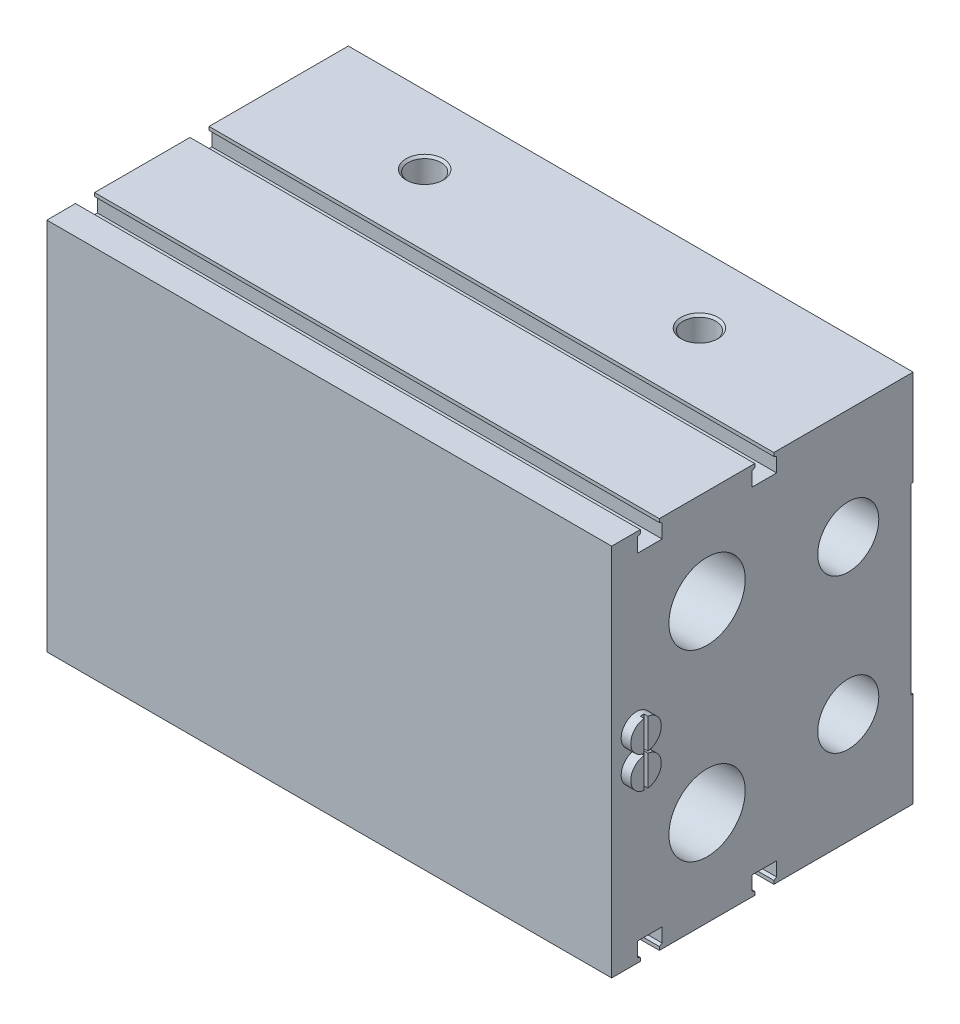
ISO-10303-21;
HEADER;
FILE_DESCRIPTION(('STEP AP214'),'2;1');
FILE_NAME('part.step','',(''),(''),'','','');
FILE_SCHEMA(('AUTOMOTIVE_DESIGN { 1 0 10303 214 1 1 1 1 }'));
ENDSEC;
DATA;
#1=APPLICATION_CONTEXT('core data for automotive mechanical design processes');
#2=APPLICATION_PROTOCOL_DEFINITION('international standard','automotive_design',2000,#1);
#3=PRODUCT_CONTEXT('',#1,'mechanical');
#4=PRODUCT('Part','Part','',(#3));
#5=PRODUCT_RELATED_PRODUCT_CATEGORY('part','',(#4));
#6=PRODUCT_DEFINITION_FORMATION('','',#4);
#7=PRODUCT_DEFINITION_CONTEXT('part definition',#1,'design');
#8=PRODUCT_DEFINITION('design','',#6,#7);
#9=PRODUCT_DEFINITION_SHAPE('','',#8);
#10=(LENGTH_UNIT() NAMED_UNIT(*) SI_UNIT(.MILLI.,.METRE.));
#11=(NAMED_UNIT(*) PLANE_ANGLE_UNIT() SI_UNIT($,.RADIAN.));
#12=(NAMED_UNIT(*) SI_UNIT($,.STERADIAN.) SOLID_ANGLE_UNIT());
#13=UNCERTAINTY_MEASURE_WITH_UNIT(LENGTH_MEASURE(1.E-05),#10,'distance_accuracy_value','');
#14=(GEOMETRIC_REPRESENTATION_CONTEXT(3) GLOBAL_UNCERTAINTY_ASSIGNED_CONTEXT((#13)) GLOBAL_UNIT_ASSIGNED_CONTEXT((#10,
#11,#12)) REPRESENTATION_CONTEXT('',''));
#15=CARTESIAN_POINT('',(0.,0.,0.));
#16=DIRECTION('',(0.,0.,1.));
#17=DIRECTION('',(1.,0.,0.));
#18=AXIS2_PLACEMENT_3D('',#15,#16,#17);
#19=CARTESIAN_POINT('',(-76.5,0.231373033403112,37.));
#20=DIRECTION('',(-1.,0.,0.));
#21=DIRECTION('',(0.,1.,0.));
#22=AXIS2_PLACEMENT_3D('',#19,#20,#21);
#23=PLANE('',#22);
#24=DIRECTION('',(0.,-1.,0.));
#25=VECTOR('',#24,1.);
#26=CARTESIAN_POINT('',(-76.5,8.16862696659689,33.5));
#27=LINE('',#26,#25);
#28=CARTESIAN_POINT('',(-76.5,8.16862696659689,33.5));
#29=VERTEX_POINT('',#28);
#30=CARTESIAN_POINT('',(-76.5,0.231373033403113,33.5));
#31=VERTEX_POINT('',#30);
#32=EDGE_CURVE('E422',#29,#31,#27,.T.);
#33=ORIENTED_EDGE('',*,*,#32,.T.);
#34=CARTESIAN_POINT('',(-76.5,4.2,33.));
#35=DIRECTION('',(-1.,0.,0.));
#36=DIRECTION('',(0.,0.,1.));
#37=AXIS2_PLACEMENT_3D('',#34,#35,#36);
#38=CIRCLE('',#37,4.);
#39=EDGE_CURVE('E411',#29,#31,#38,.F.);
#40=ORIENTED_EDGE('',*,*,#39,.F.);
#41=EDGE_LOOP('',(#33,#40));
#42=FACE_BOUND('',#41,.T.);
#43=ADVANCED_FACE('F17',(#42),#23,.T.);
#44=CARTESIAN_POINT('',(-76.5,0.231373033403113,32.5));
#45=DIRECTION('',(-1.,0.,0.));
#46=DIRECTION('',(0.,1.,0.));
#47=AXIS2_PLACEMENT_3D('',#44,#45,#46);
#48=PLANE('',#47);
#49=DIRECTION('',(0.,1.,0.));
#50=VECTOR('',#49,1.);
#51=CARTESIAN_POINT('',(-76.5,0.231373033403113,32.5));
#52=LINE('',#51,#50);
#53=CARTESIAN_POINT('',(-76.5,0.231373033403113,32.5));
#54=VERTEX_POINT('',#53);
#55=CARTESIAN_POINT('',(-76.5,8.16862696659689,32.5));
#56=VERTEX_POINT('',#55);
#57=EDGE_CURVE('E421',#54,#56,#52,.T.);
#58=ORIENTED_EDGE('',*,*,#57,.T.);
#59=CARTESIAN_POINT('',(-76.5,4.2,33.));
#60=DIRECTION('',(-1.,0.,0.));
#61=DIRECTION('',(0.,0.,-1.));
#62=AXIS2_PLACEMENT_3D('',#59,#60,#61);
#63=CIRCLE('',#62,4.);
#64=EDGE_CURVE('E439',#54,#56,#63,.F.);
#65=ORIENTED_EDGE('',*,*,#64,.F.);
#66=EDGE_LOOP('',(#58,#65));
#67=FACE_BOUND('',#66,.T.);
#68=ADVANCED_FACE('F1417',(#67),#48,.T.);
#69=CARTESIAN_POINT('',(-76.5,-8.16862696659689,37.));
#70=DIRECTION('',(-1.,0.,0.));
#71=DIRECTION('',(0.,1.,0.));
#72=AXIS2_PLACEMENT_3D('',#69,#70,#71);
#73=PLANE('',#72);
#74=DIRECTION('',(0.,-1.,0.));
#75=VECTOR('',#74,1.);
#76=CARTESIAN_POINT('',(-76.5,-0.231373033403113,33.5));
#77=LINE('',#76,#75);
#78=CARTESIAN_POINT('',(-76.5,-8.16862696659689,33.5));
#79=VERTEX_POINT('',#78);
#80=CARTESIAN_POINT('',(-76.5,-0.231373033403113,33.5));
#81=VERTEX_POINT('',#80);
#82=EDGE_CURVE('E443',#79,#81,#77,.F.);
#83=ORIENTED_EDGE('',*,*,#82,.F.);
#84=CARTESIAN_POINT('',(-76.5,-4.2,33.));
#85=DIRECTION('',(-1.,0.,0.));
#86=DIRECTION('',(0.,0.,1.));
#87=AXIS2_PLACEMENT_3D('',#84,#85,#86);
#88=CIRCLE('',#87,4.);
#89=EDGE_CURVE('E448',#81,#79,#88,.F.);
#90=ORIENTED_EDGE('',*,*,#89,.F.);
#91=EDGE_LOOP('',(#83,#90));
#92=FACE_BOUND('',#91,.T.);
#93=ADVANCED_FACE('F1422',(#92),#73,.T.);
#94=CARTESIAN_POINT('',(-76.5,-8.16862696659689,32.5));
#95=DIRECTION('',(-1.,0.,0.));
#96=DIRECTION('',(0.,1.,0.));
#97=AXIS2_PLACEMENT_3D('',#94,#95,#96);
#98=PLANE('',#97);
#99=DIRECTION('',(0.,1.,0.));
#100=VECTOR('',#99,1.);
#101=CARTESIAN_POINT('',(-76.5,-8.16862696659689,32.5));
#102=LINE('',#101,#100);
#103=CARTESIAN_POINT('',(-76.5,-0.231373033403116,32.5));
#104=VERTEX_POINT('',#103);
#105=CARTESIAN_POINT('',(-76.5,-8.16862696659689,32.5));
#106=VERTEX_POINT('',#105);
#107=EDGE_CURVE('E452',#104,#106,#102,.F.);
#108=ORIENTED_EDGE('',*,*,#107,.F.);
#109=CARTESIAN_POINT('',(-76.5,-4.2,33.));
#110=DIRECTION('',(-1.,0.,0.));
#111=DIRECTION('',(0.,0.,-1.));
#112=AXIS2_PLACEMENT_3D('',#109,#110,#111);
#113=CIRCLE('',#112,4.);
#114=EDGE_CURVE('E457',#106,#104,#113,.F.);
#115=ORIENTED_EDGE('',*,*,#114,.F.);
#116=EDGE_LOOP('',(#108,#115));
#117=FACE_BOUND('',#116,.T.);
#118=ADVANCED_FACE('F1428',(#117),#98,.T.);
#119=CARTESIAN_POINT('',(76.5,0.231373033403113,37.));
#120=DIRECTION('',(1.,0.,0.));
#121=DIRECTION('',(0.,0.,-1.));
#122=AXIS2_PLACEMENT_3D('',#119,#120,#121);
#123=PLANE('',#122);
#124=DIRECTION('',(0.,1.,0.));
#125=VECTOR('',#124,1.);
#126=CARTESIAN_POINT('',(76.5,0.231373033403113,33.5));
#127=LINE('',#126,#125);
#128=CARTESIAN_POINT('',(76.5,8.16862696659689,33.5));
#129=VERTEX_POINT('',#128);
#130=CARTESIAN_POINT('',(76.5,0.231373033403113,33.5));
#131=VERTEX_POINT('',#130);
#132=EDGE_CURVE('E461',#129,#131,#127,.F.);
#133=ORIENTED_EDGE('',*,*,#132,.F.);
#134=CARTESIAN_POINT('',(76.5,4.2,33.));
#135=DIRECTION('',(1.,0.,0.));
#136=DIRECTION('',(0.,0.,1.));
#137=AXIS2_PLACEMENT_3D('',#134,#135,#136);
#138=CIRCLE('',#137,4.);
#139=EDGE_CURVE('E466',#129,#131,#138,.T.);
#140=ORIENTED_EDGE('',*,*,#139,.T.);
#141=EDGE_LOOP('',(#133,#140));
#142=FACE_BOUND('',#141,.T.);
#143=ADVANCED_FACE('F1432',(#142),#123,.T.);
#144=CARTESIAN_POINT('',(76.5,-8.16862696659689,37.));
#145=DIRECTION('',(1.,0.,0.));
#146=DIRECTION('',(0.,0.,-1.));
#147=AXIS2_PLACEMENT_3D('',#144,#145,#146);
#148=PLANE('',#147);
#149=DIRECTION('',(0.,1.,0.));
#150=VECTOR('',#149,1.);
#151=CARTESIAN_POINT('',(76.5,-8.16862696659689,33.5));
#152=LINE('',#151,#150);
#153=CARTESIAN_POINT('',(76.5,-0.231373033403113,33.5));
#154=VERTEX_POINT('',#153);
#155=CARTESIAN_POINT('',(76.5,-8.16862696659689,33.5));
#156=VERTEX_POINT('',#155);
#157=EDGE_CURVE('E471',#154,#156,#152,.F.);
#158=ORIENTED_EDGE('',*,*,#157,.F.);
#159=CARTESIAN_POINT('',(76.5,-4.2,33.));
#160=DIRECTION('',(1.,0.,0.));
#161=DIRECTION('',(0.,0.,1.));
#162=AXIS2_PLACEMENT_3D('',#159,#160,#161);
#163=CIRCLE('',#162,4.);
#164=EDGE_CURVE('E476',#154,#156,#163,.T.);
#165=ORIENTED_EDGE('',*,*,#164,.T.);
#166=EDGE_LOOP('',(#158,#165));
#167=FACE_BOUND('',#166,.T.);
#168=ADVANCED_FACE('F1436',(#167),#148,.T.);
#169=CARTESIAN_POINT('',(74.,-49.,39.5));
#170=DIRECTION('',(0.,0.,1.));
#171=DIRECTION('',(0.,1.,0.));
#172=AXIS2_PLACEMENT_3D('',#169,#170,#171);
#173=PLANE('',#172);
#174=DIRECTION('',(0.,-1.,0.));
#175=VECTOR('',#174,1.);
#176=CARTESIAN_POINT('',(-74.,49.,39.5));
#177=LINE('',#176,#175);
#178=CARTESIAN_POINT('',(-74.,49.,39.5));
#179=VERTEX_POINT('',#178);
#180=CARTESIAN_POINT('',(-74.,-49.,39.5));
#181=VERTEX_POINT('',#180);
#182=EDGE_CURVE('E481',#179,#181,#177,.T.);
#183=ORIENTED_EDGE('',*,*,#182,.T.);
#184=DIRECTION('',(1.,0.,0.));
#185=VECTOR('',#184,1.);
#186=CARTESIAN_POINT('',(-74.,-49.,39.5));
#187=LINE('',#186,#185);
#188=CARTESIAN_POINT('',(74.,-49.,39.5));
#189=VERTEX_POINT('',#188);
#190=EDGE_CURVE('E486',#189,#181,#187,.F.);
#191=ORIENTED_EDGE('',*,*,#190,.F.);
#192=DIRECTION('',(0.,1.,0.));
#193=VECTOR('',#192,1.);
#194=CARTESIAN_POINT('',(74.,-49.,39.5));
#195=LINE('',#194,#193);
#196=CARTESIAN_POINT('',(74.,49.,39.5));
#197=VERTEX_POINT('',#196);
#198=EDGE_CURVE('E491',#197,#189,#195,.F.);
#199=ORIENTED_EDGE('',*,*,#198,.F.);
#200=DIRECTION('',(-1.,0.,0.));
#201=VECTOR('',#200,1.);
#202=CARTESIAN_POINT('',(74.,49.,39.5));
#203=LINE('',#202,#201);
#204=EDGE_CURVE('E495',#197,#179,#203,.T.);
#205=ORIENTED_EDGE('',*,*,#204,.T.);
#206=EDGE_LOOP('',(#183,#191,#199,#205));
#207=FACE_BOUND('',#206,.T.);
#208=ADVANCED_FACE('F1440',(#207),#173,.T.);
#209=CARTESIAN_POINT('',(-74.,-49.,32.));
#210=DIRECTION('',(0.,-1.,0.));
#211=DIRECTION('',(1.,0.,0.));
#212=AXIS2_PLACEMENT_3D('',#209,#210,#211);
#213=PLANE('',#212);
#214=DIRECTION('',(0.,0.,-1.));
#215=VECTOR('',#214,1.);
#216=CARTESIAN_POINT('',(-74.,-49.,39.5));
#217=LINE('',#216,#215);
#218=CARTESIAN_POINT('',(-74.,-49.,32.));
#219=VERTEX_POINT('',#218);
#220=EDGE_CURVE('E500',#181,#219,#217,.T.);
#221=ORIENTED_EDGE('',*,*,#220,.T.);
#222=DIRECTION('',(1.,0.,0.));
#223=VECTOR('',#222,1.);
#224=CARTESIAN_POINT('',(-74.,-49.,32.));
#225=LINE('',#224,#223);
#226=CARTESIAN_POINT('',(74.,-49.,32.));
#227=VERTEX_POINT('',#226);
#228=EDGE_CURVE('E505',#227,#219,#225,.F.);
#229=ORIENTED_EDGE('',*,*,#228,.F.);
#230=DIRECTION('',(0.,0.,1.));
#231=VECTOR('',#230,1.);
#232=CARTESIAN_POINT('',(74.,-49.,32.));
#233=LINE('',#232,#231);
#234=EDGE_CURVE('E510',#189,#227,#233,.F.);
#235=ORIENTED_EDGE('',*,*,#234,.F.);
#236=ORIENTED_EDGE('',*,*,#190,.T.);
#237=EDGE_LOOP('',(#221,#229,#235,#236));
#238=FACE_BOUND('',#237,.T.);
#239=ADVANCED_FACE('F1444',(#238),#213,.T.);
#240=CARTESIAN_POINT('',(-74.,-49.,32.));
#241=DIRECTION('',(0.,0.,-1.));
#242=DIRECTION('',(0.,1.,0.));
#243=AXIS2_PLACEMENT_3D('',#240,#241,#242);
#244=PLANE('',#243);
#245=DIRECTION('',(0.,1.,0.));
#246=VECTOR('',#245,1.);
#247=CARTESIAN_POINT('',(-74.,-49.,32.));
#248=LINE('',#247,#246);
#249=CARTESIAN_POINT('',(-74.,-48.1,32.));
#250=VERTEX_POINT('',#249);
#251=EDGE_CURVE('E514',#219,#250,#248,.T.);
#252=ORIENTED_EDGE('',*,*,#251,.T.);
#253=DIRECTION('',(1.,0.,0.));
#254=VECTOR('',#253,1.);
#255=CARTESIAN_POINT('',(-74.,-48.1,32.));
#256=LINE('',#255,#254);
#257=CARTESIAN_POINT('',(74.,-48.1,32.));
#258=VERTEX_POINT('',#257);
#259=EDGE_CURVE('E519',#258,#250,#256,.F.);
#260=ORIENTED_EDGE('',*,*,#259,.F.);
#261=DIRECTION('',(0.,-1.,0.));
#262=VECTOR('',#261,1.);
#263=CARTESIAN_POINT('',(74.,-48.1,32.));
#264=LINE('',#263,#262);
#265=EDGE_CURVE('E524',#227,#258,#264,.F.);
#266=ORIENTED_EDGE('',*,*,#265,.F.);
#267=ORIENTED_EDGE('',*,*,#228,.T.);
#268=EDGE_LOOP('',(#252,#260,#266,#267));
#269=FACE_BOUND('',#268,.T.);
#270=ADVANCED_FACE('F1448',(#269),#244,.T.);
#271=CARTESIAN_POINT('',(-74.,-47.681421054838,32.725));
#272=DIRECTION('',(0.,0.866025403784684,-0.499999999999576));
#273=DIRECTION('',(1.,0.,0.));
#274=AXIS2_PLACEMENT_3D('',#271,#272,#273);
#275=PLANE('',#274);
#276=DIRECTION('',(0.,0.499999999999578,0.866025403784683));
#277=VECTOR('',#276,1.);
#278=CARTESIAN_POINT('',(-74.,-48.1,32.));
#279=LINE('',#278,#277);
#280=CARTESIAN_POINT('',(-74.,-47.681421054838,32.725));
#281=VERTEX_POINT('',#280);
#282=EDGE_CURVE('E528',#250,#281,#279,.T.);
#283=ORIENTED_EDGE('',*,*,#282,.T.);
#284=DIRECTION('',(1.,0.,0.));
#285=VECTOR('',#284,1.);
#286=CARTESIAN_POINT('',(-74.,-47.681421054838,32.725));
#287=LINE('',#286,#285);
#288=CARTESIAN_POINT('',(74.,-47.681421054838,32.725));
#289=VERTEX_POINT('',#288);
#290=EDGE_CURVE('E533',#289,#281,#287,.F.);
#291=ORIENTED_EDGE('',*,*,#290,.F.);
#292=DIRECTION('',(0.,-0.499999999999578,-0.866025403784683));
#293=VECTOR('',#292,1.);
#294=CARTESIAN_POINT('',(74.,-47.681421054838,32.725));
#295=LINE('',#294,#293);
#296=EDGE_CURVE('E538',#258,#289,#295,.F.);
#297=ORIENTED_EDGE('',*,*,#296,.F.);
#298=ORIENTED_EDGE('',*,*,#259,.T.);
#299=EDGE_LOOP('',(#283,#291,#297,#298));
#300=FACE_BOUND('',#299,.T.);
#301=ADVANCED_FACE('F1452',(#300),#275,.T.);
#302=CARTESIAN_POINT('',(-74.,-47.681421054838,32.725));
#303=DIRECTION('',(0.,0.,-1.));
#304=DIRECTION('',(0.,1.,0.));
#305=AXIS2_PLACEMENT_3D('',#302,#303,#304);
#306=PLANE('',#305);
#307=DIRECTION('',(0.,1.,0.));
#308=VECTOR('',#307,1.);
#309=CARTESIAN_POINT('',(-74.,-47.681421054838,32.725));
#310=LINE('',#309,#308);
#311=CARTESIAN_POINT('',(-74.,-44.,32.725));
#312=VERTEX_POINT('',#311);
#313=EDGE_CURVE('E542',#281,#312,#310,.T.);
#314=ORIENTED_EDGE('',*,*,#313,.T.);
#315=DIRECTION('',(1.,0.,0.));
#316=VECTOR('',#315,1.);
#317=CARTESIAN_POINT('',(-74.,-44.,32.725));
#318=LINE('',#317,#316);
#319=CARTESIAN_POINT('',(74.,-44.,32.725));
#320=VERTEX_POINT('',#319);
#321=EDGE_CURVE('E547',#320,#312,#318,.F.);
#322=ORIENTED_EDGE('',*,*,#321,.F.);
#323=DIRECTION('',(0.,-1.,0.));
#324=VECTOR('',#323,1.);
#325=CARTESIAN_POINT('',(74.,-44.,32.725));
#326=LINE('',#325,#324);
#327=EDGE_CURVE('E552',#289,#320,#326,.F.);
#328=ORIENTED_EDGE('',*,*,#327,.F.);
#329=ORIENTED_EDGE('',*,*,#290,.T.);
#330=EDGE_LOOP('',(#314,#322,#328,#329));
#331=FACE_BOUND('',#330,.T.);
#332=ADVANCED_FACE('F1456',(#331),#306,.T.);
#333=CARTESIAN_POINT('',(-74.,-44.,26.275));
#334=DIRECTION('',(0.,-1.,0.));
#335=DIRECTION('',(1.,0.,0.));
#336=AXIS2_PLACEMENT_3D('',#333,#334,#335);
#337=PLANE('',#336);
#338=DIRECTION('',(0.,0.,-1.));
#339=VECTOR('',#338,1.);
#340=CARTESIAN_POINT('',(-74.,-44.,32.725));
#341=LINE('',#340,#339);
#342=CARTESIAN_POINT('',(-74.,-44.,26.275));
#343=VERTEX_POINT('',#342);
#344=EDGE_CURVE('E556',#312,#343,#341,.T.);
#345=ORIENTED_EDGE('',*,*,#344,.T.);
#346=DIRECTION('',(1.,0.,0.));
#347=VECTOR('',#346,1.);
#348=CARTESIAN_POINT('',(-74.,-44.,26.275));
#349=LINE('',#348,#347);
#350=CARTESIAN_POINT('',(74.,-44.,26.275));
#351=VERTEX_POINT('',#350);
#352=EDGE_CURVE('E561',#351,#343,#349,.F.);
#353=ORIENTED_EDGE('',*,*,#352,.F.);
#354=DIRECTION('',(0.,0.,1.));
#355=VECTOR('',#354,1.);
#356=CARTESIAN_POINT('',(74.,-44.,26.275));
#357=LINE('',#356,#355);
#358=EDGE_CURVE('E566',#320,#351,#357,.F.);
#359=ORIENTED_EDGE('',*,*,#358,.F.);
#360=ORIENTED_EDGE('',*,*,#321,.T.);
#361=EDGE_LOOP('',(#345,#353,#359,#360));
#362=FACE_BOUND('',#361,.T.);
#363=ADVANCED_FACE('F1460',(#362),#337,.T.);
#364=CARTESIAN_POINT('',(74.,-47.681421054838,26.275));
#365=DIRECTION('',(0.,0.,1.));
#366=DIRECTION('',(0.,1.,0.));
#367=AXIS2_PLACEMENT_3D('',#364,#365,#366);
#368=PLANE('',#367);
#369=DIRECTION('',(0.,-1.,0.));
#370=VECTOR('',#369,1.);
#371=CARTESIAN_POINT('',(-74.,-44.,26.275));
#372=LINE('',#371,#370);
#373=CARTESIAN_POINT('',(-74.,-47.681421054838,26.275));
#374=VERTEX_POINT('',#373);
#375=EDGE_CURVE('E570',#343,#374,#372,.T.);
#376=ORIENTED_EDGE('',*,*,#375,.T.);
#377=DIRECTION('',(1.,0.,0.));
#378=VECTOR('',#377,1.);
#379=CARTESIAN_POINT('',(-74.,-47.681421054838,26.275));
#380=LINE('',#379,#378);
#381=CARTESIAN_POINT('',(74.,-47.681421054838,26.275));
#382=VERTEX_POINT('',#381);
#383=EDGE_CURVE('E575',#382,#374,#380,.F.);
#384=ORIENTED_EDGE('',*,*,#383,.F.);
#385=DIRECTION('',(0.,1.,0.));
#386=VECTOR('',#385,1.);
#387=CARTESIAN_POINT('',(74.,-47.681421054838,26.275));
#388=LINE('',#387,#386);
#389=EDGE_CURVE('E580',#351,#382,#388,.F.);
#390=ORIENTED_EDGE('',*,*,#389,.F.);
#391=ORIENTED_EDGE('',*,*,#352,.T.);
#392=EDGE_LOOP('',(#376,#384,#390,#391));
#393=FACE_BOUND('',#392,.T.);
#394=ADVANCED_FACE('F1464',(#393),#368,.T.);
#395=CARTESIAN_POINT('',(-74.,-48.1,27.));
#396=DIRECTION('',(0.,0.866025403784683,0.499999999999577));
#397=DIRECTION('',(1.,0.,0.));
#398=AXIS2_PLACEMENT_3D('',#395,#396,#397);
#399=PLANE('',#398);
#400=DIRECTION('',(0.,-0.499999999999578,0.866025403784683));
#401=VECTOR('',#400,1.);
#402=CARTESIAN_POINT('',(-74.,-47.681421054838,26.275));
#403=LINE('',#402,#401);
#404=CARTESIAN_POINT('',(-74.,-48.1,27.));
#405=VERTEX_POINT('',#404);
#406=EDGE_CURVE('E584',#374,#405,#403,.T.);
#407=ORIENTED_EDGE('',*,*,#406,.T.);
#408=DIRECTION('',(1.,0.,0.));
#409=VECTOR('',#408,1.);
#410=CARTESIAN_POINT('',(-74.,-48.1,27.));
#411=LINE('',#410,#409);
#412=CARTESIAN_POINT('',(74.,-48.1,27.));
#413=VERTEX_POINT('',#412);
#414=EDGE_CURVE('E589',#413,#405,#411,.F.);
#415=ORIENTED_EDGE('',*,*,#414,.F.);
#416=DIRECTION('',(0.,0.499999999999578,-0.866025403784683));
#417=VECTOR('',#416,1.);
#418=CARTESIAN_POINT('',(74.,-48.1,27.));
#419=LINE('',#418,#417);
#420=EDGE_CURVE('E594',#382,#413,#419,.F.);
#421=ORIENTED_EDGE('',*,*,#420,.F.);
#422=ORIENTED_EDGE('',*,*,#383,.T.);
#423=EDGE_LOOP('',(#407,#415,#421,#422));
#424=FACE_BOUND('',#423,.T.);
#425=ADVANCED_FACE('F1468',(#424),#399,.T.);
#426=CARTESIAN_POINT('',(74.,-49.,27.));
#427=DIRECTION('',(0.,0.,1.));
#428=DIRECTION('',(0.,1.,0.));
#429=AXIS2_PLACEMENT_3D('',#426,#427,#428);
#430=PLANE('',#429);
#431=DIRECTION('',(0.,-1.,0.));
#432=VECTOR('',#431,1.);
#433=CARTESIAN_POINT('',(-74.,-48.1,27.));
#434=LINE('',#433,#432);
#435=CARTESIAN_POINT('',(-74.,-49.,27.));
#436=VERTEX_POINT('',#435);
#437=EDGE_CURVE('E598',#405,#436,#434,.T.);
#438=ORIENTED_EDGE('',*,*,#437,.T.);
#439=DIRECTION('',(1.,0.,0.));
#440=VECTOR('',#439,1.);
#441=CARTESIAN_POINT('',(-74.,-49.,27.));
#442=LINE('',#441,#440);
#443=CARTESIAN_POINT('',(74.,-49.,27.));
#444=VERTEX_POINT('',#443);
#445=EDGE_CURVE('E603',#444,#436,#442,.F.);
#446=ORIENTED_EDGE('',*,*,#445,.F.);
#447=DIRECTION('',(0.,1.,0.));
#448=VECTOR('',#447,1.);
#449=CARTESIAN_POINT('',(74.,-49.,27.));
#450=LINE('',#449,#448);
#451=EDGE_CURVE('E608',#413,#444,#450,.F.);
#452=ORIENTED_EDGE('',*,*,#451,.F.);
#453=ORIENTED_EDGE('',*,*,#414,.T.);
#454=EDGE_LOOP('',(#438,#446,#452,#453));
#455=FACE_BOUND('',#454,.T.);
#456=ADVANCED_FACE('F1472',(#455),#430,.T.);
#457=CARTESIAN_POINT('',(-74.,-49.,2.));
#458=DIRECTION('',(0.,-1.,0.));
#459=DIRECTION('',(1.,0.,0.));
#460=AXIS2_PLACEMENT_3D('',#457,#458,#459);
#461=PLANE('',#460);
#462=DIRECTION('',(0.,0.,-1.));
#463=VECTOR('',#462,1.);
#464=CARTESIAN_POINT('',(-74.,-49.,27.));
#465=LINE('',#464,#463);
#466=CARTESIAN_POINT('',(-74.,-49.,2.));
#467=VERTEX_POINT('',#466);
#468=EDGE_CURVE('E612',#436,#467,#465,.T.);
#469=ORIENTED_EDGE('',*,*,#468,.T.);
#470=DIRECTION('',(1.,0.,0.));
#471=VECTOR('',#470,1.);
#472=CARTESIAN_POINT('',(-74.,-49.,2.));
#473=LINE('',#472,#471);
#474=CARTESIAN_POINT('',(74.,-49.,2.));
#475=VERTEX_POINT('',#474);
#476=EDGE_CURVE('E617',#475,#467,#473,.F.);
#477=ORIENTED_EDGE('',*,*,#476,.F.);
#478=DIRECTION('',(0.,0.,1.));
#479=VECTOR('',#478,1.);
#480=CARTESIAN_POINT('',(74.,-49.,2.));
#481=LINE('',#480,#479);
#482=EDGE_CURVE('E622',#444,#475,#481,.F.);
#483=ORIENTED_EDGE('',*,*,#482,.F.);
#484=ORIENTED_EDGE('',*,*,#445,.T.);
#485=EDGE_LOOP('',(#469,#477,#483,#484));
#486=FACE_BOUND('',#485,.T.);
#487=ADVANCED_FACE('F1476',(#486),#461,.T.);
#488=CARTESIAN_POINT('',(-74.,-49.,2.));
#489=DIRECTION('',(0.,0.,-1.));
#490=DIRECTION('',(0.,1.,0.));
#491=AXIS2_PLACEMENT_3D('',#488,#489,#490);
#492=PLANE('',#491);
#493=DIRECTION('',(0.,1.,0.));
#494=VECTOR('',#493,1.);
#495=CARTESIAN_POINT('',(-74.,-49.,2.));
#496=LINE('',#495,#494);
#497=CARTESIAN_POINT('',(-74.,-48.1,2.));
#498=VERTEX_POINT('',#497);
#499=EDGE_CURVE('E626',#467,#498,#496,.T.);
#500=ORIENTED_EDGE('',*,*,#499,.T.);
#501=DIRECTION('',(1.,0.,0.));
#502=VECTOR('',#501,1.);
#503=CARTESIAN_POINT('',(-74.,-48.1,2.));
#504=LINE('',#503,#502);
#505=CARTESIAN_POINT('',(74.,-48.1,2.));
#506=VERTEX_POINT('',#505);
#507=EDGE_CURVE('E631',#506,#498,#504,.F.);
#508=ORIENTED_EDGE('',*,*,#507,.F.);
#509=DIRECTION('',(0.,-1.,0.));
#510=VECTOR('',#509,1.);
#511=CARTESIAN_POINT('',(74.,-48.1,2.));
#512=LINE('',#511,#510);
#513=EDGE_CURVE('E636',#475,#506,#512,.F.);
#514=ORIENTED_EDGE('',*,*,#513,.F.);
#515=ORIENTED_EDGE('',*,*,#476,.T.);
#516=EDGE_LOOP('',(#500,#508,#514,#515));
#517=FACE_BOUND('',#516,.T.);
#518=ADVANCED_FACE('F1480',(#517),#492,.T.);
#519=CARTESIAN_POINT('',(-74.,-47.681421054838,2.725));
#520=DIRECTION('',(0.,0.866025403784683,-0.499999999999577));
#521=DIRECTION('',(1.,0.,0.));
#522=AXIS2_PLACEMENT_3D('',#519,#520,#521);
#523=PLANE('',#522);
#524=DIRECTION('',(0.,0.499999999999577,0.866025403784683));
#525=VECTOR('',#524,1.);
#526=CARTESIAN_POINT('',(-74.,-48.1,2.));
#527=LINE('',#526,#525);
#528=CARTESIAN_POINT('',(-74.,-47.681421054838,2.725));
#529=VERTEX_POINT('',#528);
#530=EDGE_CURVE('E640',#498,#529,#527,.T.);
#531=ORIENTED_EDGE('',*,*,#530,.T.);
#532=DIRECTION('',(1.,0.,0.));
#533=VECTOR('',#532,1.);
#534=CARTESIAN_POINT('',(-74.,-47.681421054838,2.725));
#535=LINE('',#534,#533);
#536=CARTESIAN_POINT('',(74.,-47.681421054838,2.72499999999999));
#537=VERTEX_POINT('',#536);
#538=EDGE_CURVE('E645',#537,#529,#535,.F.);
#539=ORIENTED_EDGE('',*,*,#538,.F.);
#540=DIRECTION('',(0.,-0.499999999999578,-0.866025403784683));
#541=VECTOR('',#540,1.);
#542=CARTESIAN_POINT('',(74.,-47.681421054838,2.72499999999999));
#543=LINE('',#542,#541);
#544=EDGE_CURVE('E650',#506,#537,#543,.F.);
#545=ORIENTED_EDGE('',*,*,#544,.F.);
#546=ORIENTED_EDGE('',*,*,#507,.T.);
#547=EDGE_LOOP('',(#531,#539,#545,#546));
#548=FACE_BOUND('',#547,.T.);
#549=ADVANCED_FACE('F1484',(#548),#523,.T.);
#550=CARTESIAN_POINT('',(-74.,-47.681421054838,2.725));
#551=DIRECTION('',(0.,0.,-1.));
#552=DIRECTION('',(0.,1.,0.));
#553=AXIS2_PLACEMENT_3D('',#550,#551,#552);
#554=PLANE('',#553);
#555=DIRECTION('',(0.,1.,0.));
#556=VECTOR('',#555,1.);
#557=CARTESIAN_POINT('',(-74.,-47.681421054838,2.725));
#558=LINE('',#557,#556);
#559=CARTESIAN_POINT('',(-74.,-44.,2.725));
#560=VERTEX_POINT('',#559);
#561=EDGE_CURVE('E654',#529,#560,#558,.T.);
#562=ORIENTED_EDGE('',*,*,#561,.T.);
#563=DIRECTION('',(1.,0.,0.));
#564=VECTOR('',#563,1.);
#565=CARTESIAN_POINT('',(-74.,-44.,2.725));
#566=LINE('',#565,#564);
#567=CARTESIAN_POINT('',(74.,-44.,2.725));
#568=VERTEX_POINT('',#567);
#569=EDGE_CURVE('E659',#568,#560,#566,.F.);
#570=ORIENTED_EDGE('',*,*,#569,.F.);
#571=DIRECTION('',(0.,-1.,0.));
#572=VECTOR('',#571,1.);
#573=CARTESIAN_POINT('',(74.,-44.,2.725));
#574=LINE('',#573,#572);
#575=EDGE_CURVE('E664',#537,#568,#574,.F.);
#576=ORIENTED_EDGE('',*,*,#575,.F.);
#577=ORIENTED_EDGE('',*,*,#538,.T.);
#578=EDGE_LOOP('',(#562,#570,#576,#577));
#579=FACE_BOUND('',#578,.T.);
#580=ADVANCED_FACE('F1488',(#579),#554,.T.);
#581=CARTESIAN_POINT('',(-74.,-44.,-3.725));
#582=DIRECTION('',(0.,-1.,0.));
#583=DIRECTION('',(1.,0.,0.));
#584=AXIS2_PLACEMENT_3D('',#581,#582,#583);
#585=PLANE('',#584);
#586=DIRECTION('',(0.,0.,-1.));
#587=VECTOR('',#586,1.);
#588=CARTESIAN_POINT('',(-74.,-44.,2.725));
#589=LINE('',#588,#587);
#590=CARTESIAN_POINT('',(-74.,-44.,-3.725));
#591=VERTEX_POINT('',#590);
#592=EDGE_CURVE('E668',#560,#591,#589,.T.);
#593=ORIENTED_EDGE('',*,*,#592,.T.);
#594=DIRECTION('',(1.,0.,0.));
#595=VECTOR('',#594,1.);
#596=CARTESIAN_POINT('',(-74.,-44.,-3.725));
#597=LINE('',#596,#595);
#598=CARTESIAN_POINT('',(74.,-44.,-3.725));
#599=VERTEX_POINT('',#598);
#600=EDGE_CURVE('E673',#599,#591,#597,.F.);
#601=ORIENTED_EDGE('',*,*,#600,.F.);
#602=DIRECTION('',(0.,0.,1.));
#603=VECTOR('',#602,1.);
#604=CARTESIAN_POINT('',(74.,-44.,-3.725));
#605=LINE('',#604,#603);
#606=EDGE_CURVE('E678',#568,#599,#605,.F.);
#607=ORIENTED_EDGE('',*,*,#606,.F.);
#608=ORIENTED_EDGE('',*,*,#569,.T.);
#609=EDGE_LOOP('',(#593,#601,#607,#608));
#610=FACE_BOUND('',#609,.T.);
#611=ADVANCED_FACE('F1492',(#610),#585,.T.);
#612=CARTESIAN_POINT('',(74.,-47.681421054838,-3.725));
#613=DIRECTION('',(0.,0.,1.));
#614=DIRECTION('',(0.,1.,0.));
#615=AXIS2_PLACEMENT_3D('',#612,#613,#614);
#616=PLANE('',#615);
#617=DIRECTION('',(0.,-1.,0.));
#618=VECTOR('',#617,1.);
#619=CARTESIAN_POINT('',(-74.,-44.,-3.725));
#620=LINE('',#619,#618);
#621=CARTESIAN_POINT('',(-74.,-47.681421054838,-3.725));
#622=VERTEX_POINT('',#621);
#623=EDGE_CURVE('E682',#591,#622,#620,.T.);
#624=ORIENTED_EDGE('',*,*,#623,.T.);
#625=DIRECTION('',(1.,0.,0.));
#626=VECTOR('',#625,1.);
#627=CARTESIAN_POINT('',(-74.,-47.681421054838,-3.725));
#628=LINE('',#627,#626);
#629=CARTESIAN_POINT('',(74.,-47.681421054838,-3.725));
#630=VERTEX_POINT('',#629);
#631=EDGE_CURVE('E687',#630,#622,#628,.F.);
#632=ORIENTED_EDGE('',*,*,#631,.F.);
#633=DIRECTION('',(0.,1.,0.));
#634=VECTOR('',#633,1.);
#635=CARTESIAN_POINT('',(74.,-47.681421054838,-3.725));
#636=LINE('',#635,#634);
#637=EDGE_CURVE('E692',#599,#630,#636,.F.);
#638=ORIENTED_EDGE('',*,*,#637,.F.);
#639=ORIENTED_EDGE('',*,*,#600,.T.);
#640=EDGE_LOOP('',(#624,#632,#638,#639));
#641=FACE_BOUND('',#640,.T.);
#642=ADVANCED_FACE('F1496',(#641),#616,.T.);
#643=CARTESIAN_POINT('',(-74.,-48.1,-3.));
#644=DIRECTION('',(0.,0.866025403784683,0.499999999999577));
#645=DIRECTION('',(1.,0.,0.));
#646=AXIS2_PLACEMENT_3D('',#643,#644,#645);
#647=PLANE('',#646);
#648=DIRECTION('',(0.,-0.499999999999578,0.866025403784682));
#649=VECTOR('',#648,1.);
#650=CARTESIAN_POINT('',(-74.,-47.681421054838,-3.725));
#651=LINE('',#650,#649);
#652=CARTESIAN_POINT('',(-74.,-48.1,-3.00000000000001));
#653=VERTEX_POINT('',#652);
#654=EDGE_CURVE('E696',#622,#653,#651,.T.);
#655=ORIENTED_EDGE('',*,*,#654,.T.);
#656=DIRECTION('',(1.,0.,0.));
#657=VECTOR('',#656,1.);
#658=CARTESIAN_POINT('',(-74.,-48.1,-3.00000000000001));
#659=LINE('',#658,#657);
#660=CARTESIAN_POINT('',(74.,-48.1,-3.));
#661=VERTEX_POINT('',#660);
#662=EDGE_CURVE('E701',#661,#653,#659,.F.);
#663=ORIENTED_EDGE('',*,*,#662,.F.);
#664=DIRECTION('',(0.,0.499999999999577,-0.866025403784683));
#665=VECTOR('',#664,1.);
#666=CARTESIAN_POINT('',(74.,-48.1,-3.));
#667=LINE('',#666,#665);
#668=EDGE_CURVE('E706',#630,#661,#667,.F.);
#669=ORIENTED_EDGE('',*,*,#668,.F.);
#670=ORIENTED_EDGE('',*,*,#631,.T.);
#671=EDGE_LOOP('',(#655,#663,#669,#670));
#672=FACE_BOUND('',#671,.T.);
#673=ADVANCED_FACE('F1500',(#672),#647,.T.);
#674=CARTESIAN_POINT('',(-74.,-49.,-2.9999999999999));
#675=DIRECTION('',(0.,1.1082955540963E-13,1.));
#676=DIRECTION('',(1.,0.,0.));
#677=AXIS2_PLACEMENT_3D('',#674,#675,#676);
#678=PLANE('',#677);
#679=DIRECTION('',(0.,-1.,1.11022302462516E-13));
#680=VECTOR('',#679,1.);
#681=CARTESIAN_POINT('',(-74.,-48.1,-3.));
#682=LINE('',#681,#680);
#683=CARTESIAN_POINT('',(-74.,-49.,-2.9999999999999));
#684=VERTEX_POINT('',#683);
#685=EDGE_CURVE('E710',#653,#684,#682,.T.);
#686=ORIENTED_EDGE('',*,*,#685,.T.);
#687=DIRECTION('',(1.,0.,0.));
#688=VECTOR('',#687,1.);
#689=CARTESIAN_POINT('',(-74.,-49.,-2.9999999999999));
#690=LINE('',#689,#688);
#691=CARTESIAN_POINT('',(74.,-49.,-2.9999999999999));
#692=VERTEX_POINT('',#691);
#693=EDGE_CURVE('E715',#692,#684,#690,.F.);
#694=ORIENTED_EDGE('',*,*,#693,.F.);
#695=DIRECTION('',(0.,1.,-1.11022302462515E-13));
#696=VECTOR('',#695,1.);
#697=CARTESIAN_POINT('',(74.,-49.,-2.9999999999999));
#698=LINE('',#697,#696);
#699=EDGE_CURVE('E720',#661,#692,#698,.F.);
#700=ORIENTED_EDGE('',*,*,#699,.F.);
#701=ORIENTED_EDGE('',*,*,#662,.T.);
#702=EDGE_LOOP('',(#686,#694,#700,#701));
#703=FACE_BOUND('',#702,.T.);
#704=ADVANCED_FACE('F1504',(#703),#678,.T.);
#705=CARTESIAN_POINT('',(-74.,-49.,-39.5));
#706=DIRECTION('',(0.,-1.,0.));
#707=DIRECTION('',(1.,0.,0.));
#708=AXIS2_PLACEMENT_3D('',#705,#706,#707);
#709=PLANE('',#708);
#710=DIRECTION('',(0.,0.,-1.));
#711=VECTOR('',#710,1.);
#712=CARTESIAN_POINT('',(-74.,-49.,-2.9999999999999));
#713=LINE('',#712,#711);
#714=CARTESIAN_POINT('',(-74.,-49.,-39.5));
#715=VERTEX_POINT('',#714);
#716=EDGE_CURVE('E724',#684,#715,#713,.T.);
#717=ORIENTED_EDGE('',*,*,#716,.T.);
#718=DIRECTION('',(1.,0.,0.));
#719=VECTOR('',#718,1.);
#720=CARTESIAN_POINT('',(-74.,-49.,-39.5));
#721=LINE('',#720,#719);
#722=CARTESIAN_POINT('',(74.,-49.,-39.5));
#723=VERTEX_POINT('',#722);
#724=EDGE_CURVE('E729',#723,#715,#721,.F.);
#725=ORIENTED_EDGE('',*,*,#724,.F.);
#726=DIRECTION('',(0.,0.,1.));
#727=VECTOR('',#726,1.);
#728=CARTESIAN_POINT('',(74.,-49.,-39.5));
#729=LINE('',#728,#727);
#730=EDGE_CURVE('E734',#692,#723,#729,.F.);
#731=ORIENTED_EDGE('',*,*,#730,.F.);
#732=ORIENTED_EDGE('',*,*,#693,.T.);
#733=EDGE_LOOP('',(#717,#725,#731,#732));
#734=FACE_BOUND('',#733,.T.);
#735=CARTESIAN_POINT('',(-40.,-49.,-11.5));
#736=DIRECTION('',(0.,1.,0.));
#737=DIRECTION('',(0.,0.,-1.));
#738=AXIS2_PLACEMENT_3D('',#735,#736,#737);
#739=CIRCLE('',#738,4.99999999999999);
#740=CARTESIAN_POINT('',(-40.,-49.,-16.5));
#741=VERTEX_POINT('',#740);
#742=EDGE_CURVE('E738',#741,#741,#739,.F.);
#743=ORIENTED_EDGE('',*,*,#742,.F.);
#744=EDGE_LOOP('',(#743));
#745=FACE_BOUND('',#744,.T.);
#746=CARTESIAN_POINT('',(40.,-49.,-11.5));
#747=DIRECTION('',(0.,1.,0.));
#748=DIRECTION('',(0.,0.,-1.));
#749=AXIS2_PLACEMENT_3D('',#746,#747,#748);
#750=CIRCLE('',#749,4.99999999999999);
#751=CARTESIAN_POINT('',(40.,-49.,-16.5));
#752=VERTEX_POINT('',#751);
#753=EDGE_CURVE('E743',#752,#752,#750,.F.);
#754=ORIENTED_EDGE('',*,*,#753,.F.);
#755=EDGE_LOOP('',(#754));
#756=FACE_BOUND('',#755,.T.);
#757=ADVANCED_FACE('F1508',(#734,#745,#756),#709,.T.);
#758=CARTESIAN_POINT('',(-74.,-49.,-39.5));
#759=DIRECTION('',(0.,0.,-1.));
#760=DIRECTION('',(0.,1.,0.));
#761=AXIS2_PLACEMENT_3D('',#758,#759,#760);
#762=PLANE('',#761);
#763=DIRECTION('',(0.,1.,0.));
#764=VECTOR('',#763,1.);
#765=CARTESIAN_POINT('',(-74.,-49.,-39.5));
#766=LINE('',#765,#764);
#767=CARTESIAN_POINT('',(-74.,-24.,-39.5));
#768=VERTEX_POINT('',#767);
#769=EDGE_CURVE('E746',#715,#768,#766,.T.);
#770=ORIENTED_EDGE('',*,*,#769,.T.);
#771=DIRECTION('',(1.,0.,0.));
#772=VECTOR('',#771,1.);
#773=CARTESIAN_POINT('',(-74.,-24.,-39.5));
#774=LINE('',#773,#772);
#775=CARTESIAN_POINT('',(74.,-24.,-39.5));
#776=VERTEX_POINT('',#775);
#777=EDGE_CURVE('E749',#776,#768,#774,.F.);
#778=ORIENTED_EDGE('',*,*,#777,.F.);
#779=DIRECTION('',(0.,-1.,0.));
#780=VECTOR('',#779,1.);
#781=CARTESIAN_POINT('',(74.,-24.,-39.5));
#782=LINE('',#781,#780);
#783=EDGE_CURVE('E754',#723,#776,#782,.F.);
#784=ORIENTED_EDGE('',*,*,#783,.F.);
#785=ORIENTED_EDGE('',*,*,#724,.T.);
#786=EDGE_LOOP('',(#770,#778,#784,#785));
#787=FACE_BOUND('',#786,.T.);
#788=CARTESIAN_POINT('',(-58.,-38.,-39.5));
#789=DIRECTION('',(0.,0.,1.));
#790=DIRECTION('',(-0.99999999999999,-1.42053781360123E-07,0.));
#791=AXIS2_PLACEMENT_3D('',#788,#789,#790);
#792=CIRCLE('',#791,5.);
#793=CARTESIAN_POINT('',(-63.,-38.0000007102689,-39.5));
#794=VERTEX_POINT('',#793);
#795=EDGE_CURVE('E758',#794,#794,#792,.T.);
#796=ORIENTED_EDGE('',*,*,#795,.T.);
#797=EDGE_LOOP('',(#796));
#798=FACE_BOUND('',#797,.T.);
#799=CARTESIAN_POINT('',(58.,-38.,-39.5));
#800=DIRECTION('',(0.,0.,1.));
#801=DIRECTION('',(-0.99999999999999,-1.42053936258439E-07,0.));
#802=AXIS2_PLACEMENT_3D('',#799,#800,#801);
#803=CIRCLE('',#802,5.);
#804=CARTESIAN_POINT('',(53.0000000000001,-38.0000007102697,-39.5));
#805=VERTEX_POINT('',#804);
#806=EDGE_CURVE('E763',#805,#805,#803,.T.);
#807=ORIENTED_EDGE('',*,*,#806,.T.);
#808=EDGE_LOOP('',(#807));
#809=FACE_BOUND('',#808,.T.);
#810=CARTESIAN_POINT('',(0.,-38.,-39.5));
#811=DIRECTION('',(0.,0.,1.));
#812=DIRECTION('',(-0.99999999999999,-1.42053875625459E-07,0.));
#813=AXIS2_PLACEMENT_3D('',#810,#811,#812);
#814=CIRCLE('',#813,3.);
#815=CARTESIAN_POINT('',(-2.99999999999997,-38.0000004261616,-39.5));
#816=VERTEX_POINT('',#815);
#817=EDGE_CURVE('E766',#816,#816,#814,.T.);
#818=ORIENTED_EDGE('',*,*,#817,.T.);
#819=EDGE_LOOP('',(#818));
#820=FACE_BOUND('',#819,.T.);
#821=ADVANCED_FACE('F1512',(#787,#798,#809,#820),#762,.T.);
#822=CARTESIAN_POINT('',(-74.,-24.,-39.));
#823=DIRECTION('',(0.,1.,0.));
#824=DIRECTION('',(1.,0.,0.));
#825=AXIS2_PLACEMENT_3D('',#822,#823,#824);
#826=PLANE('',#825);
#827=DIRECTION('',(0.,0.,1.));
#828=VECTOR('',#827,1.);
#829=CARTESIAN_POINT('',(-74.,-24.,-39.5));
#830=LINE('',#829,#828);
#831=CARTESIAN_POINT('',(-74.,-24.,-39.));
#832=VERTEX_POINT('',#831);
#833=EDGE_CURVE('E769',#768,#832,#830,.T.);
#834=ORIENTED_EDGE('',*,*,#833,.T.);
#835=DIRECTION('',(1.,0.,0.));
#836=VECTOR('',#835,1.);
#837=CARTESIAN_POINT('',(-74.,-24.,-39.));
#838=LINE('',#837,#836);
#839=CARTESIAN_POINT('',(74.,-24.,-39.));
#840=VERTEX_POINT('',#839);
#841=EDGE_CURVE('E772',#840,#832,#838,.F.);
#842=ORIENTED_EDGE('',*,*,#841,.F.);
#843=DIRECTION('',(0.,0.,-1.));
#844=VECTOR('',#843,1.);
#845=CARTESIAN_POINT('',(74.,-24.,-39.));
#846=LINE('',#845,#844);
#847=EDGE_CURVE('E777',#776,#840,#846,.F.);
#848=ORIENTED_EDGE('',*,*,#847,.F.);
#849=ORIENTED_EDGE('',*,*,#777,.T.);
#850=EDGE_LOOP('',(#834,#842,#848,#849));
#851=FACE_BOUND('',#850,.T.);
#852=ADVANCED_FACE('F1516',(#851),#826,.T.);
#853=CARTESIAN_POINT('',(-74.,-24.,-39.));
#854=DIRECTION('',(0.,0.,-1.));
#855=DIRECTION('',(0.,1.,0.));
#856=AXIS2_PLACEMENT_3D('',#853,#854,#855);
#857=PLANE('',#856);
#858=DIRECTION('',(0.,1.,0.));
#859=VECTOR('',#858,1.);
#860=CARTESIAN_POINT('',(-74.,-24.,-39.));
#861=LINE('',#860,#859);
#862=CARTESIAN_POINT('',(-74.,24.,-39.));
#863=VERTEX_POINT('',#862);
#864=EDGE_CURVE('E781',#832,#863,#861,.T.);
#865=ORIENTED_EDGE('',*,*,#864,.T.);
#866=DIRECTION('',(1.,0.,0.));
#867=VECTOR('',#866,1.);
#868=CARTESIAN_POINT('',(-74.,24.,-39.));
#869=LINE('',#868,#867);
#870=CARTESIAN_POINT('',(74.,24.,-39.));
#871=VERTEX_POINT('',#870);
#872=EDGE_CURVE('E786',#871,#863,#869,.F.);
#873=ORIENTED_EDGE('',*,*,#872,.F.);
#874=DIRECTION('',(0.,-1.,0.));
#875=VECTOR('',#874,1.);
#876=CARTESIAN_POINT('',(74.,24.,-39.));
#877=LINE('',#876,#875);
#878=EDGE_CURVE('E791',#840,#871,#877,.F.);
#879=ORIENTED_EDGE('',*,*,#878,.F.);
#880=ORIENTED_EDGE('',*,*,#841,.T.);
#881=EDGE_LOOP('',(#865,#873,#879,#880));
#882=FACE_BOUND('',#881,.T.);
#883=CARTESIAN_POINT('',(0.,0.,-39.));
#884=DIRECTION('',(0.,0.,1.));
#885=DIRECTION('',(-1.,0.,0.));
#886=AXIS2_PLACEMENT_3D('',#883,#884,#885);
#887=CIRCLE('',#886,20.);
#888=CARTESIAN_POINT('',(-20.,0.,-39.));
#889=VERTEX_POINT('',#888);
#890=EDGE_CURVE('E795',#889,#889,#887,.F.);
#891=ORIENTED_EDGE('',*,*,#890,.F.);
#892=EDGE_LOOP('',(#891));
#893=FACE_BOUND('',#892,.T.);
#894=ADVANCED_FACE('F1520',(#882,#893),#857,.T.);
#895=CARTESIAN_POINT('',(-74.,24.,-39.5));
#896=DIRECTION('',(0.,-1.,0.));
#897=DIRECTION('',(1.,0.,0.));
#898=AXIS2_PLACEMENT_3D('',#895,#896,#897);
#899=PLANE('',#898);
#900=DIRECTION('',(0.,0.,-1.));
#901=VECTOR('',#900,1.);
#902=CARTESIAN_POINT('',(-74.,24.,-39.));
#903=LINE('',#902,#901);
#904=CARTESIAN_POINT('',(-74.,24.,-39.5));
#905=VERTEX_POINT('',#904);
#906=EDGE_CURVE('E800',#863,#905,#903,.T.);
#907=ORIENTED_EDGE('',*,*,#906,.T.);
#908=DIRECTION('',(1.,0.,0.));
#909=VECTOR('',#908,1.);
#910=CARTESIAN_POINT('',(-74.,24.,-39.5));
#911=LINE('',#910,#909);
#912=CARTESIAN_POINT('',(74.,24.,-39.5));
#913=VERTEX_POINT('',#912);
#914=EDGE_CURVE('E803',#913,#905,#911,.F.);
#915=ORIENTED_EDGE('',*,*,#914,.F.);
#916=DIRECTION('',(0.,0.,1.));
#917=VECTOR('',#916,1.);
#918=CARTESIAN_POINT('',(74.,24.,-39.5));
#919=LINE('',#918,#917);
#920=EDGE_CURVE('E808',#871,#913,#919,.F.);
#921=ORIENTED_EDGE('',*,*,#920,.F.);
#922=ORIENTED_EDGE('',*,*,#872,.T.);
#923=EDGE_LOOP('',(#907,#915,#921,#922));
#924=FACE_BOUND('',#923,.T.);
#925=ADVANCED_FACE('F1524',(#924),#899,.T.);
#926=CARTESIAN_POINT('',(-74.,24.,-39.5));
#927=DIRECTION('',(0.,0.,-1.));
#928=DIRECTION('',(0.,1.,0.));
#929=AXIS2_PLACEMENT_3D('',#926,#927,#928);
#930=PLANE('',#929);
#931=DIRECTION('',(0.,1.,0.));
#932=VECTOR('',#931,1.);
#933=CARTESIAN_POINT('',(-74.,24.,-39.5));
#934=LINE('',#933,#932);
#935=CARTESIAN_POINT('',(-74.,49.,-39.5));
#936=VERTEX_POINT('',#935);
#937=EDGE_CURVE('E812',#905,#936,#934,.T.);
#938=ORIENTED_EDGE('',*,*,#937,.T.);
#939=DIRECTION('',(1.,0.,0.));
#940=VECTOR('',#939,1.);
#941=CARTESIAN_POINT('',(-74.,49.,-39.5));
#942=LINE('',#941,#940);
#943=CARTESIAN_POINT('',(74.,49.,-39.5));
#944=VERTEX_POINT('',#943);
#945=EDGE_CURVE('E817',#944,#936,#942,.F.);
#946=ORIENTED_EDGE('',*,*,#945,.F.);
#947=DIRECTION('',(0.,-1.,0.));
#948=VECTOR('',#947,1.);
#949=CARTESIAN_POINT('',(74.,49.,-39.5));
#950=LINE('',#949,#948);
#951=EDGE_CURVE('E822',#913,#944,#950,.F.);
#952=ORIENTED_EDGE('',*,*,#951,.F.);
#953=ORIENTED_EDGE('',*,*,#914,.T.);
#954=EDGE_LOOP('',(#938,#946,#952,#953));
#955=FACE_BOUND('',#954,.T.);
#956=CARTESIAN_POINT('',(58.,38.,-39.5));
#957=DIRECTION('',(0.,0.,1.));
#958=DIRECTION('',(-0.99999999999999,-1.42053781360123E-07,0.));
#959=AXIS2_PLACEMENT_3D('',#956,#957,#958);
#960=CIRCLE('',#959,5.);
#961=CARTESIAN_POINT('',(53.0000000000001,37.9999992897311,-39.5));
#962=VERTEX_POINT('',#961);
#963=EDGE_CURVE('E826',#962,#962,#960,.T.);
#964=ORIENTED_EDGE('',*,*,#963,.T.);
#965=EDGE_LOOP('',(#964));
#966=FACE_BOUND('',#965,.T.);
#967=CARTESIAN_POINT('',(-58.,38.,-39.5));
#968=DIRECTION('',(0.,0.,1.));
#969=DIRECTION('',(-0.99999999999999,-1.42053936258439E-07,0.));
#970=AXIS2_PLACEMENT_3D('',#967,#968,#969);
#971=CIRCLE('',#970,5.);
#972=CARTESIAN_POINT('',(-63.,37.9999992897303,-39.5));
#973=VERTEX_POINT('',#972);
#974=EDGE_CURVE('E831',#973,#973,#971,.T.);
#975=ORIENTED_EDGE('',*,*,#974,.T.);
#976=EDGE_LOOP('',(#975));
#977=FACE_BOUND('',#976,.T.);
#978=DIRECTION('',(0.,-1.,0.));
#979=VECTOR('',#978,1.);
#980=CARTESIAN_POINT('',(-3.,38.5,-39.5));
#981=LINE('',#980,#979);
#982=CARTESIAN_POINT('',(-3.,38.5,-39.5));
#983=VERTEX_POINT('',#982);
#984=CARTESIAN_POINT('',(-3.,37.5,-39.5));
#985=VERTEX_POINT('',#984);
#986=EDGE_CURVE('E834',#983,#985,#981,.T.);
#987=ORIENTED_EDGE('',*,*,#986,.T.);
#988=CARTESIAN_POINT('',(0.,37.5,-39.5));
#989=DIRECTION('',(0.,0.,1.));
#990=DIRECTION('',(-1.,0.,0.));
#991=AXIS2_PLACEMENT_3D('',#988,#989,#990);
#992=CIRCLE('',#991,3.);
#993=CARTESIAN_POINT('',(3.,37.5,-39.5));
#994=VERTEX_POINT('',#993);
#995=EDGE_CURVE('E837',#985,#994,#992,.T.);
#996=ORIENTED_EDGE('',*,*,#995,.T.);
#997=DIRECTION('',(0.,1.,0.));
#998=VECTOR('',#997,1.);
#999=CARTESIAN_POINT('',(3.,37.5,-39.5));
#1000=LINE('',#999,#998);
#1001=CARTESIAN_POINT('',(3.,38.5,-39.5));
#1002=VERTEX_POINT('',#1001);
#1003=EDGE_CURVE('E842',#994,#1002,#1000,.T.);
#1004=ORIENTED_EDGE('',*,*,#1003,.T.);
#1005=CARTESIAN_POINT('',(0.,38.5,-39.5));
#1006=DIRECTION('',(0.,0.,1.));
#1007=DIRECTION('',(1.,0.,0.));
#1008=AXIS2_PLACEMENT_3D('',#1005,#1006,#1007);
#1009=CIRCLE('',#1008,3.);
#1010=EDGE_CURVE('E847',#1002,#983,#1009,.T.);
#1011=ORIENTED_EDGE('',*,*,#1010,.T.);
#1012=EDGE_LOOP('',(#987,#996,#1004,#1011));
#1013=FACE_BOUND('',#1012,.T.);
#1014=ADVANCED_FACE('F1528',(#955,#966,#977,#1013),#930,.T.);
#1015=CARTESIAN_POINT('',(-74.,49.,-2.9999999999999));
#1016=DIRECTION('',(0.,1.,0.));
#1017=DIRECTION('',(1.,0.,0.));
#1018=AXIS2_PLACEMENT_3D('',#1015,#1016,#1017);
#1019=PLANE('',#1018);
#1020=DIRECTION('',(0.,0.,1.));
#1021=VECTOR('',#1020,1.);
#1022=CARTESIAN_POINT('',(-74.,49.,-39.5));
#1023=LINE('',#1022,#1021);
#1024=CARTESIAN_POINT('',(-74.,49.,-2.9999999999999));
#1025=VERTEX_POINT('',#1024);
#1026=EDGE_CURVE('E852',#936,#1025,#1023,.T.);
#1027=ORIENTED_EDGE('',*,*,#1026,.T.);
#1028=DIRECTION('',(1.,0.,0.));
#1029=VECTOR('',#1028,1.);
#1030=CARTESIAN_POINT('',(-74.,49.,-2.9999999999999));
#1031=LINE('',#1030,#1029);
#1032=CARTESIAN_POINT('',(74.,49.,-2.9999999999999));
#1033=VERTEX_POINT('',#1032);
#1034=EDGE_CURVE('E857',#1033,#1025,#1031,.F.);
#1035=ORIENTED_EDGE('',*,*,#1034,.F.);
#1036=DIRECTION('',(0.,0.,-1.));
#1037=VECTOR('',#1036,1.);
#1038=CARTESIAN_POINT('',(74.,49.,-2.9999999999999));
#1039=LINE('',#1038,#1037);
#1040=EDGE_CURVE('E862',#944,#1033,#1039,.F.);
#1041=ORIENTED_EDGE('',*,*,#1040,.F.);
#1042=ORIENTED_EDGE('',*,*,#945,.T.);
#1043=EDGE_LOOP('',(#1027,#1035,#1041,#1042));
#1044=FACE_BOUND('',#1043,.T.);
#1045=CARTESIAN_POINT('',(-36.,49.,-21.5));
#1046=DIRECTION('',(0.,-1.,0.));
#1047=DIRECTION('',(-1.4205394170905E-07,0.,0.99999999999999));
#1048=AXIS2_PLACEMENT_3D('',#1045,#1046,#1047);
#1049=CIRCLE('',#1048,4.864);
#1050=CARTESIAN_POINT('',(-36.0000006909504,49.,-16.636));
#1051=VERTEX_POINT('',#1050);
#1052=EDGE_CURVE('E866',#1051,#1051,#1049,.T.);
#1053=ORIENTED_EDGE('',*,*,#1052,.T.);
#1054=EDGE_LOOP('',(#1053));
#1055=FACE_BOUND('',#1054,.T.);
#1056=CARTESIAN_POINT('',(36.,49.,-21.5));
#1057=DIRECTION('',(0.,-1.,0.));
#1058=DIRECTION('',(-1.42053944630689E-07,0.,0.99999999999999));
#1059=AXIS2_PLACEMENT_3D('',#1056,#1057,#1058);
#1060=CIRCLE('',#1059,4.864);
#1061=CARTESIAN_POINT('',(35.9999993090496,49.,-16.636));
#1062=VERTEX_POINT('',#1061);
#1063=EDGE_CURVE('E871',#1062,#1062,#1060,.T.);
#1064=ORIENTED_EDGE('',*,*,#1063,.T.);
#1065=EDGE_LOOP('',(#1064));
#1066=FACE_BOUND('',#1065,.T.);
#1067=ADVANCED_FACE('F1532',(#1044,#1055,#1066),#1019,.T.);
#1068=CARTESIAN_POINT('',(-74.,48.1,-3.));
#1069=DIRECTION('',(0.,-1.1082955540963E-13,1.));
#1070=DIRECTION('',(1.,0.,0.));
#1071=AXIS2_PLACEMENT_3D('',#1068,#1069,#1070);
#1072=PLANE('',#1071);
#1073=DIRECTION('',(0.,-1.,-1.11022302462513E-13));
#1074=VECTOR('',#1073,1.);
#1075=CARTESIAN_POINT('',(-74.,49.,-2.9999999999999));
#1076=LINE('',#1075,#1074);
#1077=CARTESIAN_POINT('',(-74.,48.1,-3.));
#1078=VERTEX_POINT('',#1077);
#1079=EDGE_CURVE('E874',#1025,#1078,#1076,.T.);
#1080=ORIENTED_EDGE('',*,*,#1079,.T.);
#1081=DIRECTION('',(1.,0.,0.));
#1082=VECTOR('',#1081,1.);
#1083=CARTESIAN_POINT('',(-74.,48.1,-3.));
#1084=LINE('',#1083,#1082);
#1085=CARTESIAN_POINT('',(74.,48.1,-3.));
#1086=VERTEX_POINT('',#1085);
#1087=EDGE_CURVE('E877',#1086,#1078,#1084,.F.);
#1088=ORIENTED_EDGE('',*,*,#1087,.F.);
#1089=DIRECTION('',(0.,1.,1.11022302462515E-13));
#1090=VECTOR('',#1089,1.);
#1091=CARTESIAN_POINT('',(74.,48.1,-3.));
#1092=LINE('',#1091,#1090);
#1093=EDGE_CURVE('E882',#1033,#1086,#1092,.F.);
#1094=ORIENTED_EDGE('',*,*,#1093,.F.);
#1095=ORIENTED_EDGE('',*,*,#1034,.T.);
#1096=EDGE_LOOP('',(#1080,#1088,#1094,#1095));
#1097=FACE_BOUND('',#1096,.T.);
#1098=ADVANCED_FACE('F1536',(#1097),#1072,.T.);
#1099=CARTESIAN_POINT('',(-74.,47.681421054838,-3.725));
#1100=DIRECTION('',(0.,-0.866025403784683,0.499999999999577));
#1101=DIRECTION('',(1.,0.,0.));
#1102=AXIS2_PLACEMENT_3D('',#1099,#1100,#1101);
#1103=PLANE('',#1102);
#1104=DIRECTION('',(0.,-0.499999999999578,-0.866025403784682));
#1105=VECTOR('',#1104,1.);
#1106=CARTESIAN_POINT('',(-74.,48.1,-3.));
#1107=LINE('',#1106,#1105);
#1108=CARTESIAN_POINT('',(-74.,47.681421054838,-3.725));
#1109=VERTEX_POINT('',#1108);
#1110=EDGE_CURVE('E886',#1078,#1109,#1107,.T.);
#1111=ORIENTED_EDGE('',*,*,#1110,.T.);
#1112=DIRECTION('',(1.,0.,0.));
#1113=VECTOR('',#1112,1.);
#1114=CARTESIAN_POINT('',(-74.,47.681421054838,-3.725));
#1115=LINE('',#1114,#1113);
#1116=CARTESIAN_POINT('',(74.,47.681421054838,-3.725));
#1117=VERTEX_POINT('',#1116);
#1118=EDGE_CURVE('E891',#1117,#1109,#1115,.F.);
#1119=ORIENTED_EDGE('',*,*,#1118,.F.);
#1120=DIRECTION('',(0.,0.499999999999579,0.866025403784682));
#1121=VECTOR('',#1120,1.);
#1122=CARTESIAN_POINT('',(74.,47.681421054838,-3.725));
#1123=LINE('',#1122,#1121);
#1124=EDGE_CURVE('E896',#1086,#1117,#1123,.F.);
#1125=ORIENTED_EDGE('',*,*,#1124,.F.);
#1126=ORIENTED_EDGE('',*,*,#1087,.T.);
#1127=EDGE_LOOP('',(#1111,#1119,#1125,#1126));
#1128=FACE_BOUND('',#1127,.T.);
#1129=ADVANCED_FACE('F1540',(#1128),#1103,.T.);
#1130=CARTESIAN_POINT('',(74.,44.,-3.725));
#1131=DIRECTION('',(0.,0.,1.));
#1132=DIRECTION('',(0.,1.,0.));
#1133=AXIS2_PLACEMENT_3D('',#1130,#1131,#1132);
#1134=PLANE('',#1133);
#1135=DIRECTION('',(0.,-1.,0.));
#1136=VECTOR('',#1135,1.);
#1137=CARTESIAN_POINT('',(-74.,47.681421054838,-3.725));
#1138=LINE('',#1137,#1136);
#1139=CARTESIAN_POINT('',(-74.,44.,-3.725));
#1140=VERTEX_POINT('',#1139);
#1141=EDGE_CURVE('E900',#1109,#1140,#1138,.T.);
#1142=ORIENTED_EDGE('',*,*,#1141,.T.);
#1143=DIRECTION('',(1.,0.,0.));
#1144=VECTOR('',#1143,1.);
#1145=CARTESIAN_POINT('',(-74.,44.,-3.725));
#1146=LINE('',#1145,#1144);
#1147=CARTESIAN_POINT('',(74.,44.,-3.725));
#1148=VERTEX_POINT('',#1147);
#1149=EDGE_CURVE('E905',#1148,#1140,#1146,.F.);
#1150=ORIENTED_EDGE('',*,*,#1149,.F.);
#1151=DIRECTION('',(0.,1.,0.));
#1152=VECTOR('',#1151,1.);
#1153=CARTESIAN_POINT('',(74.,44.,-3.725));
#1154=LINE('',#1153,#1152);
#1155=EDGE_CURVE('E910',#1117,#1148,#1154,.F.);
#1156=ORIENTED_EDGE('',*,*,#1155,.F.);
#1157=ORIENTED_EDGE('',*,*,#1118,.T.);
#1158=EDGE_LOOP('',(#1142,#1150,#1156,#1157));
#1159=FACE_BOUND('',#1158,.T.);
#1160=ADVANCED_FACE('F1544',(#1159),#1134,.T.);
#1161=CARTESIAN_POINT('',(-74.,44.,2.725));
#1162=DIRECTION('',(0.,1.,0.));
#1163=DIRECTION('',(1.,0.,0.));
#1164=AXIS2_PLACEMENT_3D('',#1161,#1162,#1163);
#1165=PLANE('',#1164);
#1166=DIRECTION('',(0.,0.,1.));
#1167=VECTOR('',#1166,1.);
#1168=CARTESIAN_POINT('',(-74.,44.,-3.725));
#1169=LINE('',#1168,#1167);
#1170=CARTESIAN_POINT('',(-74.,44.,2.725));
#1171=VERTEX_POINT('',#1170);
#1172=EDGE_CURVE('E914',#1140,#1171,#1169,.T.);
#1173=ORIENTED_EDGE('',*,*,#1172,.T.);
#1174=DIRECTION('',(1.,0.,0.));
#1175=VECTOR('',#1174,1.);
#1176=CARTESIAN_POINT('',(-74.,44.,2.725));
#1177=LINE('',#1176,#1175);
#1178=CARTESIAN_POINT('',(74.,44.,2.725));
#1179=VERTEX_POINT('',#1178);
#1180=EDGE_CURVE('E919',#1179,#1171,#1177,.F.);
#1181=ORIENTED_EDGE('',*,*,#1180,.F.);
#1182=DIRECTION('',(0.,0.,-1.));
#1183=VECTOR('',#1182,1.);
#1184=CARTESIAN_POINT('',(74.,44.,2.725));
#1185=LINE('',#1184,#1183);
#1186=EDGE_CURVE('E924',#1148,#1179,#1185,.F.);
#1187=ORIENTED_EDGE('',*,*,#1186,.F.);
#1188=ORIENTED_EDGE('',*,*,#1149,.T.);
#1189=EDGE_LOOP('',(#1173,#1181,#1187,#1188));
#1190=FACE_BOUND('',#1189,.T.);
#1191=ADVANCED_FACE('F1548',(#1190),#1165,.T.);
#1192=CARTESIAN_POINT('',(-74.,44.,2.725));
#1193=DIRECTION('',(0.,0.,-1.));
#1194=DIRECTION('',(0.,1.,0.));
#1195=AXIS2_PLACEMENT_3D('',#1192,#1193,#1194);
#1196=PLANE('',#1195);
#1197=DIRECTION('',(0.,1.,0.));
#1198=VECTOR('',#1197,1.);
#1199=CARTESIAN_POINT('',(-74.,44.,2.725));
#1200=LINE('',#1199,#1198);
#1201=CARTESIAN_POINT('',(-74.,47.681421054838,2.725));
#1202=VERTEX_POINT('',#1201);
#1203=EDGE_CURVE('E928',#1171,#1202,#1200,.T.);
#1204=ORIENTED_EDGE('',*,*,#1203,.T.);
#1205=DIRECTION('',(1.,0.,0.));
#1206=VECTOR('',#1205,1.);
#1207=CARTESIAN_POINT('',(-74.,47.681421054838,2.725));
#1208=LINE('',#1207,#1206);
#1209=CARTESIAN_POINT('',(74.,47.681421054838,2.725));
#1210=VERTEX_POINT('',#1209);
#1211=EDGE_CURVE('E933',#1210,#1202,#1208,.F.);
#1212=ORIENTED_EDGE('',*,*,#1211,.F.);
#1213=DIRECTION('',(0.,-1.,0.));
#1214=VECTOR('',#1213,1.);
#1215=CARTESIAN_POINT('',(74.,47.681421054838,2.725));
#1216=LINE('',#1215,#1214);
#1217=EDGE_CURVE('E938',#1179,#1210,#1216,.F.);
#1218=ORIENTED_EDGE('',*,*,#1217,.F.);
#1219=ORIENTED_EDGE('',*,*,#1180,.T.);
#1220=EDGE_LOOP('',(#1204,#1212,#1218,#1219));
#1221=FACE_BOUND('',#1220,.T.);
#1222=ADVANCED_FACE('F1552',(#1221),#1196,.T.);
#1223=CARTESIAN_POINT('',(-74.,48.1,2.));
#1224=DIRECTION('',(0.,-0.866025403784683,-0.499999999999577));
#1225=DIRECTION('',(1.,0.,0.));
#1226=AXIS2_PLACEMENT_3D('',#1223,#1224,#1225);
#1227=PLANE('',#1226);
#1228=DIRECTION('',(0.,0.499999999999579,-0.866025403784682));
#1229=VECTOR('',#1228,1.);
#1230=CARTESIAN_POINT('',(-74.,47.681421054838,2.72500000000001));
#1231=LINE('',#1230,#1229);
#1232=CARTESIAN_POINT('',(-74.,48.1,2.));
#1233=VERTEX_POINT('',#1232);
#1234=EDGE_CURVE('E942',#1202,#1233,#1231,.T.);
#1235=ORIENTED_EDGE('',*,*,#1234,.T.);
#1236=DIRECTION('',(1.,0.,0.));
#1237=VECTOR('',#1236,1.);
#1238=CARTESIAN_POINT('',(-74.,48.1,2.));
#1239=LINE('',#1238,#1237);
#1240=CARTESIAN_POINT('',(74.,48.1,2.00000000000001));
#1241=VERTEX_POINT('',#1240);
#1242=EDGE_CURVE('E947',#1241,#1233,#1239,.F.);
#1243=ORIENTED_EDGE('',*,*,#1242,.F.);
#1244=DIRECTION('',(0.,-0.499999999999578,0.866025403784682));
#1245=VECTOR('',#1244,1.);
#1246=CARTESIAN_POINT('',(74.,48.1,2.00000000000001));
#1247=LINE('',#1246,#1245);
#1248=EDGE_CURVE('E952',#1210,#1241,#1247,.F.);
#1249=ORIENTED_EDGE('',*,*,#1248,.F.);
#1250=ORIENTED_EDGE('',*,*,#1211,.T.);
#1251=EDGE_LOOP('',(#1235,#1243,#1249,#1250));
#1252=FACE_BOUND('',#1251,.T.);
#1253=ADVANCED_FACE('F1556',(#1252),#1227,.T.);
#1254=CARTESIAN_POINT('',(-74.,48.1,2.));
#1255=DIRECTION('',(0.,0.,-1.));
#1256=DIRECTION('',(0.,1.,0.));
#1257=AXIS2_PLACEMENT_3D('',#1254,#1255,#1256);
#1258=PLANE('',#1257);
#1259=DIRECTION('',(0.,1.,0.));
#1260=VECTOR('',#1259,1.);
#1261=CARTESIAN_POINT('',(-74.,48.1,2.));
#1262=LINE('',#1261,#1260);
#1263=CARTESIAN_POINT('',(-74.,49.,2.));
#1264=VERTEX_POINT('',#1263);
#1265=EDGE_CURVE('E956',#1233,#1264,#1262,.T.);
#1266=ORIENTED_EDGE('',*,*,#1265,.T.);
#1267=DIRECTION('',(1.,0.,0.));
#1268=VECTOR('',#1267,1.);
#1269=CARTESIAN_POINT('',(-74.,49.,2.));
#1270=LINE('',#1269,#1268);
#1271=CARTESIAN_POINT('',(74.,49.,2.));
#1272=VERTEX_POINT('',#1271);
#1273=EDGE_CURVE('E961',#1272,#1264,#1270,.F.);
#1274=ORIENTED_EDGE('',*,*,#1273,.F.);
#1275=DIRECTION('',(0.,-1.,0.));
#1276=VECTOR('',#1275,1.);
#1277=CARTESIAN_POINT('',(74.,49.,2.));
#1278=LINE('',#1277,#1276);
#1279=EDGE_CURVE('E966',#1241,#1272,#1278,.F.);
#1280=ORIENTED_EDGE('',*,*,#1279,.F.);
#1281=ORIENTED_EDGE('',*,*,#1242,.T.);
#1282=EDGE_LOOP('',(#1266,#1274,#1280,#1281));
#1283=FACE_BOUND('',#1282,.T.);
#1284=ADVANCED_FACE('F1560',(#1283),#1258,.T.);
#1285=CARTESIAN_POINT('',(-74.,49.,27.));
#1286=DIRECTION('',(0.,1.,0.));
#1287=DIRECTION('',(1.,0.,0.));
#1288=AXIS2_PLACEMENT_3D('',#1285,#1286,#1287);
#1289=PLANE('',#1288);
#1290=DIRECTION('',(0.,0.,1.));
#1291=VECTOR('',#1290,1.);
#1292=CARTESIAN_POINT('',(-74.,49.,2.));
#1293=LINE('',#1292,#1291);
#1294=CARTESIAN_POINT('',(-74.,49.,27.));
#1295=VERTEX_POINT('',#1294);
#1296=EDGE_CURVE('E970',#1264,#1295,#1293,.T.);
#1297=ORIENTED_EDGE('',*,*,#1296,.T.);
#1298=DIRECTION('',(1.,0.,0.));
#1299=VECTOR('',#1298,1.);
#1300=CARTESIAN_POINT('',(-74.,49.,27.));
#1301=LINE('',#1300,#1299);
#1302=CARTESIAN_POINT('',(74.,49.,27.));
#1303=VERTEX_POINT('',#1302);
#1304=EDGE_CURVE('E975',#1303,#1295,#1301,.F.);
#1305=ORIENTED_EDGE('',*,*,#1304,.F.);
#1306=DIRECTION('',(0.,0.,-1.));
#1307=VECTOR('',#1306,1.);
#1308=CARTESIAN_POINT('',(74.,49.,27.));
#1309=LINE('',#1308,#1307);
#1310=EDGE_CURVE('E980',#1272,#1303,#1309,.F.);
#1311=ORIENTED_EDGE('',*,*,#1310,.F.);
#1312=ORIENTED_EDGE('',*,*,#1273,.T.);
#1313=EDGE_LOOP('',(#1297,#1305,#1311,#1312));
#1314=FACE_BOUND('',#1313,.T.);
#1315=ADVANCED_FACE('F1564',(#1314),#1289,.T.);
#1316=CARTESIAN_POINT('',(74.,48.1,27.));
#1317=DIRECTION('',(0.,0.,1.));
#1318=DIRECTION('',(0.,1.,0.));
#1319=AXIS2_PLACEMENT_3D('',#1316,#1317,#1318);
#1320=PLANE('',#1319);
#1321=DIRECTION('',(0.,-1.,0.));
#1322=VECTOR('',#1321,1.);
#1323=CARTESIAN_POINT('',(-74.,49.,27.));
#1324=LINE('',#1323,#1322);
#1325=CARTESIAN_POINT('',(-74.,48.1,27.));
#1326=VERTEX_POINT('',#1325);
#1327=EDGE_CURVE('E984',#1295,#1326,#1324,.T.);
#1328=ORIENTED_EDGE('',*,*,#1327,.T.);
#1329=DIRECTION('',(1.,0.,0.));
#1330=VECTOR('',#1329,1.);
#1331=CARTESIAN_POINT('',(-74.,48.1,27.));
#1332=LINE('',#1331,#1330);
#1333=CARTESIAN_POINT('',(74.,48.1,27.));
#1334=VERTEX_POINT('',#1333);
#1335=EDGE_CURVE('E989',#1334,#1326,#1332,.F.);
#1336=ORIENTED_EDGE('',*,*,#1335,.F.);
#1337=DIRECTION('',(0.,1.,0.));
#1338=VECTOR('',#1337,1.);
#1339=CARTESIAN_POINT('',(74.,48.1,27.));
#1340=LINE('',#1339,#1338);
#1341=EDGE_CURVE('E994',#1303,#1334,#1340,.F.);
#1342=ORIENTED_EDGE('',*,*,#1341,.F.);
#1343=ORIENTED_EDGE('',*,*,#1304,.T.);
#1344=EDGE_LOOP('',(#1328,#1336,#1342,#1343));
#1345=FACE_BOUND('',#1344,.T.);
#1346=ADVANCED_FACE('F1568',(#1345),#1320,.T.);
#1347=CARTESIAN_POINT('',(-74.,47.681421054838,26.275));
#1348=DIRECTION('',(0.,-0.866025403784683,0.499999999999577));
#1349=DIRECTION('',(1.,0.,0.));
#1350=AXIS2_PLACEMENT_3D('',#1347,#1348,#1349);
#1351=PLANE('',#1350);
#1352=DIRECTION('',(0.,-0.499999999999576,-0.866025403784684));
#1353=VECTOR('',#1352,1.);
#1354=CARTESIAN_POINT('',(-74.,48.1,27.));
#1355=LINE('',#1354,#1353);
#1356=CARTESIAN_POINT('',(-74.,47.681421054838,26.275));
#1357=VERTEX_POINT('',#1356);
#1358=EDGE_CURVE('E998',#1326,#1357,#1355,.T.);
#1359=ORIENTED_EDGE('',*,*,#1358,.T.);
#1360=DIRECTION('',(1.,0.,0.));
#1361=VECTOR('',#1360,1.);
#1362=CARTESIAN_POINT('',(-74.,47.681421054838,26.275));
#1363=LINE('',#1362,#1361);
#1364=CARTESIAN_POINT('',(74.,47.681421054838,26.275));
#1365=VERTEX_POINT('',#1364);
#1366=EDGE_CURVE('E1003',#1365,#1357,#1363,.F.);
#1367=ORIENTED_EDGE('',*,*,#1366,.F.);
#1368=DIRECTION('',(0.,0.499999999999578,0.866025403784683));
#1369=VECTOR('',#1368,1.);
#1370=CARTESIAN_POINT('',(74.,47.681421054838,26.275));
#1371=LINE('',#1370,#1369);
#1372=EDGE_CURVE('E1008',#1334,#1365,#1371,.F.);
#1373=ORIENTED_EDGE('',*,*,#1372,.F.);
#1374=ORIENTED_EDGE('',*,*,#1335,.T.);
#1375=EDGE_LOOP('',(#1359,#1367,#1373,#1374));
#1376=FACE_BOUND('',#1375,.T.);
#1377=ADVANCED_FACE('F1572',(#1376),#1351,.T.);
#1378=CARTESIAN_POINT('',(74.,44.,26.275));
#1379=DIRECTION('',(0.,0.,1.));
#1380=DIRECTION('',(0.,1.,0.));
#1381=AXIS2_PLACEMENT_3D('',#1378,#1379,#1380);
#1382=PLANE('',#1381);
#1383=DIRECTION('',(0.,-1.,0.));
#1384=VECTOR('',#1383,1.);
#1385=CARTESIAN_POINT('',(-74.,47.681421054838,26.275));
#1386=LINE('',#1385,#1384);
#1387=CARTESIAN_POINT('',(-74.,44.,26.275));
#1388=VERTEX_POINT('',#1387);
#1389=EDGE_CURVE('E1012',#1357,#1388,#1386,.T.);
#1390=ORIENTED_EDGE('',*,*,#1389,.T.);
#1391=DIRECTION('',(1.,0.,0.));
#1392=VECTOR('',#1391,1.);
#1393=CARTESIAN_POINT('',(-74.,44.,26.275));
#1394=LINE('',#1393,#1392);
#1395=CARTESIAN_POINT('',(74.,44.,26.275));
#1396=VERTEX_POINT('',#1395);
#1397=EDGE_CURVE('E1017',#1396,#1388,#1394,.F.);
#1398=ORIENTED_EDGE('',*,*,#1397,.F.);
#1399=DIRECTION('',(0.,1.,0.));
#1400=VECTOR('',#1399,1.);
#1401=CARTESIAN_POINT('',(74.,44.,26.275));
#1402=LINE('',#1401,#1400);
#1403=EDGE_CURVE('E1022',#1365,#1396,#1402,.F.);
#1404=ORIENTED_EDGE('',*,*,#1403,.F.);
#1405=ORIENTED_EDGE('',*,*,#1366,.T.);
#1406=EDGE_LOOP('',(#1390,#1398,#1404,#1405));
#1407=FACE_BOUND('',#1406,.T.);
#1408=ADVANCED_FACE('F1576',(#1407),#1382,.T.);
#1409=CARTESIAN_POINT('',(-74.,44.,32.725));
#1410=DIRECTION('',(0.,1.,0.));
#1411=DIRECTION('',(1.,0.,0.));
#1412=AXIS2_PLACEMENT_3D('',#1409,#1410,#1411);
#1413=PLANE('',#1412);
#1414=DIRECTION('',(0.,0.,1.));
#1415=VECTOR('',#1414,1.);
#1416=CARTESIAN_POINT('',(-74.,44.,26.275));
#1417=LINE('',#1416,#1415);
#1418=CARTESIAN_POINT('',(-74.,44.,32.725));
#1419=VERTEX_POINT('',#1418);
#1420=EDGE_CURVE('E1026',#1388,#1419,#1417,.T.);
#1421=ORIENTED_EDGE('',*,*,#1420,.T.);
#1422=DIRECTION('',(1.,0.,0.));
#1423=VECTOR('',#1422,1.);
#1424=CARTESIAN_POINT('',(-74.,44.,32.725));
#1425=LINE('',#1424,#1423);
#1426=CARTESIAN_POINT('',(74.,44.,32.725));
#1427=VERTEX_POINT('',#1426);
#1428=EDGE_CURVE('E1031',#1427,#1419,#1425,.F.);
#1429=ORIENTED_EDGE('',*,*,#1428,.F.);
#1430=DIRECTION('',(0.,0.,-1.));
#1431=VECTOR('',#1430,1.);
#1432=CARTESIAN_POINT('',(74.,44.,32.725));
#1433=LINE('',#1432,#1431);
#1434=EDGE_CURVE('E1036',#1396,#1427,#1433,.F.);
#1435=ORIENTED_EDGE('',*,*,#1434,.F.);
#1436=ORIENTED_EDGE('',*,*,#1397,.T.);
#1437=EDGE_LOOP('',(#1421,#1429,#1435,#1436));
#1438=FACE_BOUND('',#1437,.T.);
#1439=ADVANCED_FACE('F1580',(#1438),#1413,.T.);
#1440=CARTESIAN_POINT('',(-74.,44.,32.725));
#1441=DIRECTION('',(0.,0.,-1.));
#1442=DIRECTION('',(0.,1.,0.));
#1443=AXIS2_PLACEMENT_3D('',#1440,#1441,#1442);
#1444=PLANE('',#1443);
#1445=DIRECTION('',(0.,1.,0.));
#1446=VECTOR('',#1445,1.);
#1447=CARTESIAN_POINT('',(-74.,44.,32.725));
#1448=LINE('',#1447,#1446);
#1449=CARTESIAN_POINT('',(-74.,47.681421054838,32.725));
#1450=VERTEX_POINT('',#1449);
#1451=EDGE_CURVE('E1040',#1419,#1450,#1448,.T.);
#1452=ORIENTED_EDGE('',*,*,#1451,.T.);
#1453=DIRECTION('',(1.,0.,0.));
#1454=VECTOR('',#1453,1.);
#1455=CARTESIAN_POINT('',(-74.,47.681421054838,32.725));
#1456=LINE('',#1455,#1454);
#1457=CARTESIAN_POINT('',(74.,47.681421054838,32.725));
#1458=VERTEX_POINT('',#1457);
#1459=EDGE_CURVE('E1045',#1458,#1450,#1456,.F.);
#1460=ORIENTED_EDGE('',*,*,#1459,.F.);
#1461=DIRECTION('',(0.,-1.,0.));
#1462=VECTOR('',#1461,1.);
#1463=CARTESIAN_POINT('',(74.,47.681421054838,32.725));
#1464=LINE('',#1463,#1462);
#1465=EDGE_CURVE('E1050',#1427,#1458,#1464,.F.);
#1466=ORIENTED_EDGE('',*,*,#1465,.F.);
#1467=ORIENTED_EDGE('',*,*,#1428,.T.);
#1468=EDGE_LOOP('',(#1452,#1460,#1466,#1467));
#1469=FACE_BOUND('',#1468,.T.);
#1470=ADVANCED_FACE('F1584',(#1469),#1444,.T.);
#1471=CARTESIAN_POINT('',(-74.,48.1,32.));
#1472=DIRECTION('',(0.,-0.866025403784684,-0.499999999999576));
#1473=DIRECTION('',(1.,0.,0.));
#1474=AXIS2_PLACEMENT_3D('',#1471,#1472,#1473);
#1475=PLANE('',#1474);
#1476=DIRECTION('',(0.,0.499999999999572,-0.866025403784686));
#1477=VECTOR('',#1476,1.);
#1478=CARTESIAN_POINT('',(-74.,47.681421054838,32.725));
#1479=LINE('',#1478,#1477);
#1480=CARTESIAN_POINT('',(-74.,48.1,32.));
#1481=VERTEX_POINT('',#1480);
#1482=EDGE_CURVE('E1054',#1450,#1481,#1479,.T.);
#1483=ORIENTED_EDGE('',*,*,#1482,.T.);
#1484=DIRECTION('',(1.,0.,0.));
#1485=VECTOR('',#1484,1.);
#1486=CARTESIAN_POINT('',(-74.,48.1,32.));
#1487=LINE('',#1486,#1485);
#1488=CARTESIAN_POINT('',(74.,48.1,32.));
#1489=VERTEX_POINT('',#1488);
#1490=EDGE_CURVE('E1059',#1489,#1481,#1487,.F.);
#1491=ORIENTED_EDGE('',*,*,#1490,.F.);
#1492=DIRECTION('',(0.,-0.499999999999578,0.866025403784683));
#1493=VECTOR('',#1492,1.);
#1494=CARTESIAN_POINT('',(74.,48.1,32.));
#1495=LINE('',#1494,#1493);
#1496=EDGE_CURVE('E1064',#1458,#1489,#1495,.F.);
#1497=ORIENTED_EDGE('',*,*,#1496,.F.);
#1498=ORIENTED_EDGE('',*,*,#1459,.T.);
#1499=EDGE_LOOP('',(#1483,#1491,#1497,#1498));
#1500=FACE_BOUND('',#1499,.T.);
#1501=ADVANCED_FACE('F1588',(#1500),#1475,.T.);
#1502=CARTESIAN_POINT('',(-74.,48.1,32.));
#1503=DIRECTION('',(0.,0.,-1.));
#1504=DIRECTION('',(0.,1.,0.));
#1505=AXIS2_PLACEMENT_3D('',#1502,#1503,#1504);
#1506=PLANE('',#1505);
#1507=DIRECTION('',(0.,1.,0.));
#1508=VECTOR('',#1507,1.);
#1509=CARTESIAN_POINT('',(-74.,48.1,32.));
#1510=LINE('',#1509,#1508);
#1511=CARTESIAN_POINT('',(-74.,49.,32.));
#1512=VERTEX_POINT('',#1511);
#1513=EDGE_CURVE('E1068',#1481,#1512,#1510,.T.);
#1514=ORIENTED_EDGE('',*,*,#1513,.T.);
#1515=DIRECTION('',(1.,0.,0.));
#1516=VECTOR('',#1515,1.);
#1517=CARTESIAN_POINT('',(-74.,49.,32.));
#1518=LINE('',#1517,#1516);
#1519=CARTESIAN_POINT('',(74.,49.,32.));
#1520=VERTEX_POINT('',#1519);
#1521=EDGE_CURVE('E1073',#1520,#1512,#1518,.F.);
#1522=ORIENTED_EDGE('',*,*,#1521,.F.);
#1523=DIRECTION('',(0.,-1.,0.));
#1524=VECTOR('',#1523,1.);
#1525=CARTESIAN_POINT('',(74.,49.,32.));
#1526=LINE('',#1525,#1524);
#1527=EDGE_CURVE('E1078',#1489,#1520,#1526,.F.);
#1528=ORIENTED_EDGE('',*,*,#1527,.F.);
#1529=ORIENTED_EDGE('',*,*,#1490,.T.);
#1530=EDGE_LOOP('',(#1514,#1522,#1528,#1529));
#1531=FACE_BOUND('',#1530,.T.);
#1532=ADVANCED_FACE('F1592',(#1531),#1506,.T.);
#1533=CARTESIAN_POINT('',(-74.,49.,39.5));
#1534=DIRECTION('',(0.,1.,0.));
#1535=DIRECTION('',(1.,0.,0.));
#1536=AXIS2_PLACEMENT_3D('',#1533,#1534,#1535);
#1537=PLANE('',#1536);
#1538=DIRECTION('',(0.,0.,1.));
#1539=VECTOR('',#1538,1.);
#1540=CARTESIAN_POINT('',(-74.,49.,32.));
#1541=LINE('',#1540,#1539);
#1542=EDGE_CURVE('E1082',#1512,#179,#1541,.T.);
#1543=ORIENTED_EDGE('',*,*,#1542,.T.);
#1544=ORIENTED_EDGE('',*,*,#204,.F.);
#1545=DIRECTION('',(0.,0.,-1.));
#1546=VECTOR('',#1545,1.);
#1547=CARTESIAN_POINT('',(74.,49.,39.5));
#1548=LINE('',#1547,#1546);
#1549=EDGE_CURVE('E1087',#1520,#197,#1548,.F.);
#1550=ORIENTED_EDGE('',*,*,#1549,.F.);
#1551=ORIENTED_EDGE('',*,*,#1521,.T.);
#1552=EDGE_LOOP('',(#1543,#1544,#1550,#1551));
#1553=FACE_BOUND('',#1552,.T.);
#1554=ADVANCED_FACE('F1596',(#1553),#1537,.T.);
#1555=CARTESIAN_POINT('',(74.,-49.,39.5));
#1556=DIRECTION('',(1.,0.,0.));
#1557=DIRECTION('',(0.,0.,-1.));
#1558=AXIS2_PLACEMENT_3D('',#1555,#1556,#1557);
#1559=PLANE('',#1558);
#1560=ORIENTED_EDGE('',*,*,#198,.T.);
#1561=ORIENTED_EDGE('',*,*,#234,.T.);
#1562=ORIENTED_EDGE('',*,*,#265,.T.);
#1563=ORIENTED_EDGE('',*,*,#296,.T.);
#1564=ORIENTED_EDGE('',*,*,#327,.T.);
#1565=ORIENTED_EDGE('',*,*,#358,.T.);
#1566=ORIENTED_EDGE('',*,*,#389,.T.);
#1567=ORIENTED_EDGE('',*,*,#420,.T.);
#1568=ORIENTED_EDGE('',*,*,#451,.T.);
#1569=ORIENTED_EDGE('',*,*,#482,.T.);
#1570=ORIENTED_EDGE('',*,*,#513,.T.);
#1571=ORIENTED_EDGE('',*,*,#544,.T.);
#1572=ORIENTED_EDGE('',*,*,#575,.T.);
#1573=ORIENTED_EDGE('',*,*,#606,.T.);
#1574=ORIENTED_EDGE('',*,*,#637,.T.);
#1575=ORIENTED_EDGE('',*,*,#668,.T.);
#1576=ORIENTED_EDGE('',*,*,#699,.T.);
#1577=ORIENTED_EDGE('',*,*,#730,.T.);
#1578=ORIENTED_EDGE('',*,*,#783,.T.);
#1579=ORIENTED_EDGE('',*,*,#847,.T.);
#1580=ORIENTED_EDGE('',*,*,#878,.T.);
#1581=ORIENTED_EDGE('',*,*,#920,.T.);
#1582=ORIENTED_EDGE('',*,*,#951,.T.);
#1583=ORIENTED_EDGE('',*,*,#1040,.T.);
#1584=ORIENTED_EDGE('',*,*,#1093,.T.);
#1585=ORIENTED_EDGE('',*,*,#1124,.T.);
#1586=ORIENTED_EDGE('',*,*,#1155,.T.);
#1587=ORIENTED_EDGE('',*,*,#1186,.T.);
#1588=ORIENTED_EDGE('',*,*,#1217,.T.);
#1589=ORIENTED_EDGE('',*,*,#1248,.T.);
#1590=ORIENTED_EDGE('',*,*,#1279,.T.);
#1591=ORIENTED_EDGE('',*,*,#1310,.T.);
#1592=ORIENTED_EDGE('',*,*,#1341,.T.);
#1593=ORIENTED_EDGE('',*,*,#1372,.T.);
#1594=ORIENTED_EDGE('',*,*,#1403,.T.);
#1595=ORIENTED_EDGE('',*,*,#1434,.T.);
#1596=ORIENTED_EDGE('',*,*,#1465,.T.);
#1597=ORIENTED_EDGE('',*,*,#1496,.T.);
#1598=ORIENTED_EDGE('',*,*,#1527,.T.);
#1599=ORIENTED_EDGE('',*,*,#1549,.T.);
#1600=EDGE_LOOP('',(#1560,#1561,#1562,#1563,#1564,#1565,#1566,#1567,#1568,#1569,#1570,#1571,
#1572,#1573,#1574,#1575,#1576,#1577,#1578,#1579,#1580,#1581,#1582,#1583,#1584,#1585,#1586,#1587,
#1588,#1589,#1590,#1591,#1592,#1593,#1594,#1595,#1596,#1597,#1598,#1599));
#1601=FACE_BOUND('',#1600,.T.);
#1602=CARTESIAN_POINT('',(74.,-24.,14.5));
#1603=DIRECTION('',(-1.,0.,0.));
#1604=DIRECTION('',(0.,-1.16842926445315E-09,-1.));
#1605=AXIS2_PLACEMENT_3D('',#1602,#1603,#1604);
#1606=CIRCLE('',#1605,10.);
#1607=CARTESIAN_POINT('',(74.,-24.0000000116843,4.5));
#1608=VERTEX_POINT('',#1607);
#1609=EDGE_CURVE('E1091',#1608,#1608,#1606,.F.);
#1610=ORIENTED_EDGE('',*,*,#1609,.F.);
#1611=EDGE_LOOP('',(#1610));
#1612=FACE_BOUND('',#1611,.T.);
#1613=CARTESIAN_POINT('',(74.,24.,14.5));
#1614=DIRECTION('',(-1.,0.,0.));
#1615=DIRECTION('',(0.,-1.16842784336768E-09,-1.));
#1616=AXIS2_PLACEMENT_3D('',#1613,#1614,#1615);
#1617=CIRCLE('',#1616,10.);
#1618=CARTESIAN_POINT('',(74.,23.9999999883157,4.5));
#1619=VERTEX_POINT('',#1618);
#1620=EDGE_CURVE('E1096',#1619,#1619,#1617,.F.);
#1621=ORIENTED_EDGE('',*,*,#1620,.F.);
#1622=EDGE_LOOP('',(#1621));
#1623=FACE_BOUND('',#1622,.T.);
#1624=CARTESIAN_POINT('',(74.,-20.1,-22.5));
#1625=DIRECTION('',(-1.,0.,0.));
#1626=DIRECTION('',(0.,0.,-1.));
#1627=AXIS2_PLACEMENT_3D('',#1624,#1625,#1626);
#1628=CIRCLE('',#1627,8.);
#1629=CARTESIAN_POINT('',(74.,-20.1,-30.5));
#1630=VERTEX_POINT('',#1629);
#1631=EDGE_CURVE('E1099',#1630,#1630,#1628,.F.);
#1632=ORIENTED_EDGE('',*,*,#1631,.F.);
#1633=EDGE_LOOP('',(#1632));
#1634=FACE_BOUND('',#1633,.T.);
#1635=CARTESIAN_POINT('',(74.,20.1,-22.5));
#1636=DIRECTION('',(-1.,0.,0.));
#1637=DIRECTION('',(0.,0.,-1.));
#1638=AXIS2_PLACEMENT_3D('',#1635,#1636,#1637);
#1639=CIRCLE('',#1638,8.);
#1640=CARTESIAN_POINT('',(74.,20.1,-30.5));
#1641=VERTEX_POINT('',#1640);
#1642=EDGE_CURVE('E1102',#1641,#1641,#1639,.F.);
#1643=ORIENTED_EDGE('',*,*,#1642,.F.);
#1644=EDGE_LOOP('',(#1643));
#1645=FACE_BOUND('',#1644,.T.);
#1646=CARTESIAN_POINT('',(74.,4.2,33.));
#1647=DIRECTION('',(-1.,0.,0.));
#1648=DIRECTION('',(0.,0.,-1.));
#1649=AXIS2_PLACEMENT_3D('',#1646,#1647,#1648);
#1650=CIRCLE('',#1649,4.);
#1651=CARTESIAN_POINT('',(74.,4.2,29.));
#1652=VERTEX_POINT('',#1651);
#1653=EDGE_CURVE('E1105',#1652,#1652,#1650,.F.);
#1654=ORIENTED_EDGE('',*,*,#1653,.F.);
#1655=EDGE_LOOP('',(#1654));
#1656=FACE_BOUND('',#1655,.T.);
#1657=CARTESIAN_POINT('',(74.,-4.2,33.));
#1658=DIRECTION('',(-1.,0.,0.));
#1659=DIRECTION('',(0.,0.,-1.));
#1660=AXIS2_PLACEMENT_3D('',#1657,#1658,#1659);
#1661=CIRCLE('',#1660,4.);
#1662=CARTESIAN_POINT('',(74.,-4.2,29.));
#1663=VERTEX_POINT('',#1662);
#1664=EDGE_CURVE('E1108',#1663,#1663,#1661,.F.);
#1665=ORIENTED_EDGE('',*,*,#1664,.F.);
#1666=EDGE_LOOP('',(#1665));
#1667=FACE_BOUND('',#1666,.T.);
#1668=ADVANCED_FACE('F1600',(#1601,#1612,#1623,#1634,#1645,#1656,#1667),#1559,.T.);
#1669=CARTESIAN_POINT('',(-74.,-49.,39.5));
#1670=DIRECTION('',(-1.,0.,0.));
#1671=DIRECTION('',(0.,1.,0.));
#1672=AXIS2_PLACEMENT_3D('',#1669,#1670,#1671);
#1673=PLANE('',#1672);
#1674=ORIENTED_EDGE('',*,*,#182,.F.);
#1675=ORIENTED_EDGE('',*,*,#1542,.F.);
#1676=ORIENTED_EDGE('',*,*,#1513,.F.);
#1677=ORIENTED_EDGE('',*,*,#1482,.F.);
#1678=ORIENTED_EDGE('',*,*,#1451,.F.);
#1679=ORIENTED_EDGE('',*,*,#1420,.F.);
#1680=ORIENTED_EDGE('',*,*,#1389,.F.);
#1681=ORIENTED_EDGE('',*,*,#1358,.F.);
#1682=ORIENTED_EDGE('',*,*,#1327,.F.);
#1683=ORIENTED_EDGE('',*,*,#1296,.F.);
#1684=ORIENTED_EDGE('',*,*,#1265,.F.);
#1685=ORIENTED_EDGE('',*,*,#1234,.F.);
#1686=ORIENTED_EDGE('',*,*,#1203,.F.);
#1687=ORIENTED_EDGE('',*,*,#1172,.F.);
#1688=ORIENTED_EDGE('',*,*,#1141,.F.);
#1689=ORIENTED_EDGE('',*,*,#1110,.F.);
#1690=ORIENTED_EDGE('',*,*,#1079,.F.);
#1691=ORIENTED_EDGE('',*,*,#1026,.F.);
#1692=ORIENTED_EDGE('',*,*,#937,.F.);
#1693=ORIENTED_EDGE('',*,*,#906,.F.);
#1694=ORIENTED_EDGE('',*,*,#864,.F.);
#1695=ORIENTED_EDGE('',*,*,#833,.F.);
#1696=ORIENTED_EDGE('',*,*,#769,.F.);
#1697=ORIENTED_EDGE('',*,*,#716,.F.);
#1698=ORIENTED_EDGE('',*,*,#685,.F.);
#1699=ORIENTED_EDGE('',*,*,#654,.F.);
#1700=ORIENTED_EDGE('',*,*,#623,.F.);
#1701=ORIENTED_EDGE('',*,*,#592,.F.);
#1702=ORIENTED_EDGE('',*,*,#561,.F.);
#1703=ORIENTED_EDGE('',*,*,#530,.F.);
#1704=ORIENTED_EDGE('',*,*,#499,.F.);
#1705=ORIENTED_EDGE('',*,*,#468,.F.);
#1706=ORIENTED_EDGE('',*,*,#437,.F.);
#1707=ORIENTED_EDGE('',*,*,#406,.F.);
#1708=ORIENTED_EDGE('',*,*,#375,.F.);
#1709=ORIENTED_EDGE('',*,*,#344,.F.);
#1710=ORIENTED_EDGE('',*,*,#313,.F.);
#1711=ORIENTED_EDGE('',*,*,#282,.F.);
#1712=ORIENTED_EDGE('',*,*,#251,.F.);
#1713=ORIENTED_EDGE('',*,*,#220,.F.);
#1714=EDGE_LOOP('',(#1674,#1675,#1676,#1677,#1678,#1679,#1680,#1681,#1682,#1683,#1684,#1685,
#1686,#1687,#1688,#1689,#1690,#1691,#1692,#1693,#1694,#1695,#1696,#1697,#1698,#1699,#1700,#1701,
#1702,#1703,#1704,#1705,#1706,#1707,#1708,#1709,#1710,#1711,#1712,#1713));
#1715=FACE_BOUND('',#1714,.T.);
#1716=CARTESIAN_POINT('',(-74.,-24.,14.5));
#1717=DIRECTION('',(1.,0.,0.));
#1718=DIRECTION('',(0.,0.,1.));
#1719=AXIS2_PLACEMENT_3D('',#1716,#1717,#1718);
#1720=CIRCLE('',#1719,10.);
#1721=CARTESIAN_POINT('',(-74.,-24.,24.5));
#1722=VERTEX_POINT('',#1721);
#1723=EDGE_CURVE('E1111',#1722,#1722,#1720,.T.);
#1724=ORIENTED_EDGE('',*,*,#1723,.T.);
#1725=EDGE_LOOP('',(#1724));
#1726=FACE_BOUND('',#1725,.T.);
#1727=CARTESIAN_POINT('',(-74.,24.,14.5));
#1728=DIRECTION('',(1.,0.,0.));
#1729=DIRECTION('',(0.,0.,1.));
#1730=AXIS2_PLACEMENT_3D('',#1727,#1728,#1729);
#1731=CIRCLE('',#1730,10.);
#1732=CARTESIAN_POINT('',(-74.,24.,24.5));
#1733=VERTEX_POINT('',#1732);
#1734=EDGE_CURVE('E1114',#1733,#1733,#1731,.T.);
#1735=ORIENTED_EDGE('',*,*,#1734,.T.);
#1736=EDGE_LOOP('',(#1735));
#1737=FACE_BOUND('',#1736,.T.);
#1738=CARTESIAN_POINT('',(-74.,-20.1,-22.5));
#1739=DIRECTION('',(1.,0.,0.));
#1740=DIRECTION('',(0.,-1.168357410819E-09,1.));
#1741=AXIS2_PLACEMENT_3D('',#1738,#1739,#1740);
#1742=CIRCLE('',#1741,8.);
#1743=CARTESIAN_POINT('',(-74.,-20.1000000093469,-14.5));
#1744=VERTEX_POINT('',#1743);
#1745=EDGE_CURVE('E1117',#1744,#1744,#1742,.T.);
#1746=ORIENTED_EDGE('',*,*,#1745,.T.);
#1747=EDGE_LOOP('',(#1746));
#1748=FACE_BOUND('',#1747,.T.);
#1749=CARTESIAN_POINT('',(-74.,20.1,-22.5));
#1750=DIRECTION('',(1.,0.,0.));
#1751=DIRECTION('',(0.,-1.16835874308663E-09,1.));
#1752=AXIS2_PLACEMENT_3D('',#1749,#1750,#1751);
#1753=CIRCLE('',#1752,8.);
#1754=CARTESIAN_POINT('',(-74.,20.0999999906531,-14.5));
#1755=VERTEX_POINT('',#1754);
#1756=EDGE_CURVE('E1120',#1755,#1755,#1753,.T.);
#1757=ORIENTED_EDGE('',*,*,#1756,.T.);
#1758=EDGE_LOOP('',(#1757));
#1759=FACE_BOUND('',#1758,.T.);
#1760=CARTESIAN_POINT('',(-74.,4.2,33.));
#1761=DIRECTION('',(1.,0.,0.));
#1762=DIRECTION('',(0.,-1.42053870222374E-07,0.99999999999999));
#1763=AXIS2_PLACEMENT_3D('',#1760,#1761,#1762);
#1764=CIRCLE('',#1763,4.);
#1765=CARTESIAN_POINT('',(-74.,4.19999943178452,37.));
#1766=VERTEX_POINT('',#1765);
#1767=EDGE_CURVE('E1123',#1766,#1766,#1764,.T.);
#1768=ORIENTED_EDGE('',*,*,#1767,.T.);
#1769=EDGE_LOOP('',(#1768));
#1770=FACE_BOUND('',#1769,.T.);
#1771=CARTESIAN_POINT('',(-74.,-4.2,33.));
#1772=DIRECTION('',(1.,0.,0.));
#1773=DIRECTION('',(0.,-1.42053864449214E-07,0.99999999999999));
#1774=AXIS2_PLACEMENT_3D('',#1771,#1772,#1773);
#1775=CIRCLE('',#1774,4.);
#1776=CARTESIAN_POINT('',(-74.,-4.20000056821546,37.));
#1777=VERTEX_POINT('',#1776);
#1778=EDGE_CURVE('E1126',#1777,#1777,#1775,.T.);
#1779=ORIENTED_EDGE('',*,*,#1778,.T.);
#1780=EDGE_LOOP('',(#1779));
#1781=FACE_BOUND('',#1780,.T.);
#1782=ADVANCED_FACE('F1604',(#1715,#1726,#1737,#1748,#1759,#1770,#1781),#1673,.T.);
#1783=CARTESIAN_POINT('',(-2.,11.6721125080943,26.5));
#1784=DIRECTION('',(1.,0.,0.));
#1785=DIRECTION('',(0.,0.,-1.));
#1786=AXIS2_PLACEMENT_3D('',#1783,#1784,#1785);
#1787=PLANE('',#1786);
#1788=CARTESIAN_POINT('',(-2.,24.,14.5));
#1789=DIRECTION('',(1.,0.,0.));
#1790=DIRECTION('',(0.,0.,1.));
#1791=AXIS2_PLACEMENT_3D('',#1788,#1789,#1790);
#1792=CIRCLE('',#1791,12.);
#1793=CARTESIAN_POINT('',(-2.,24.,26.5));
#1794=VERTEX_POINT('',#1793);
#1795=EDGE_CURVE('E1129',#1794,#1794,#1792,.T.);
#1796=ORIENTED_EDGE('',*,*,#1795,.T.);
#1797=EDGE_LOOP('',(#1796));
#1798=FACE_BOUND('',#1797,.T.);
#1799=CARTESIAN_POINT('',(-2.,24.,14.5));
#1800=DIRECTION('',(-1.,0.,0.));
#1801=DIRECTION('',(0.,-1.16842997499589E-09,-1.));
#1802=AXIS2_PLACEMENT_3D('',#1799,#1800,#1801);
#1803=CIRCLE('',#1802,10.);
#1804=CARTESIAN_POINT('',(-2.,23.9999999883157,4.5));
#1805=VERTEX_POINT('',#1804);
#1806=EDGE_CURVE('E1132',#1805,#1805,#1803,.F.);
#1807=ORIENTED_EDGE('',*,*,#1806,.F.);
#1808=EDGE_LOOP('',(#1807));
#1809=FACE_BOUND('',#1808,.T.);
#1810=ADVANCED_FACE('F1608',(#1798,#1809),#1787,.T.);
#1811=CARTESIAN_POINT('',(53.,11.6721125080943,2.5));
#1812=DIRECTION('',(-1.,0.,0.));
#1813=DIRECTION('',(0.,0.,1.));
#1814=AXIS2_PLACEMENT_3D('',#1811,#1812,#1813);
#1815=PLANE('',#1814);
#1816=CARTESIAN_POINT('',(53.,24.,14.5));
#1817=DIRECTION('',(-1.,0.,0.));
#1818=DIRECTION('',(0.,0.,-1.));
#1819=AXIS2_PLACEMENT_3D('',#1816,#1817,#1818);
#1820=CIRCLE('',#1819,12.);
#1821=CARTESIAN_POINT('',(53.,24.,2.5));
#1822=VERTEX_POINT('',#1821);
#1823=EDGE_CURVE('E1135',#1822,#1822,#1820,.F.);
#1824=ORIENTED_EDGE('',*,*,#1823,.F.);
#1825=EDGE_LOOP('',(#1824));
#1826=FACE_BOUND('',#1825,.T.);
#1827=CARTESIAN_POINT('',(53.,24.,14.5));
#1828=DIRECTION('',(1.,0.,0.));
#1829=DIRECTION('',(0.,0.,1.));
#1830=AXIS2_PLACEMENT_3D('',#1827,#1828,#1829);
#1831=CIRCLE('',#1830,10.);
#1832=CARTESIAN_POINT('',(53.,24.,24.5));
#1833=VERTEX_POINT('',#1832);
#1834=EDGE_CURVE('E1138',#1833,#1833,#1831,.F.);
#1835=ORIENTED_EDGE('',*,*,#1834,.F.);
#1836=EDGE_LOOP('',(#1835));
#1837=FACE_BOUND('',#1836,.T.);
#1838=ADVANCED_FACE('F1612',(#1826,#1837),#1815,.T.);
#1839=CARTESIAN_POINT('',(-53.,-36.3278874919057,26.5));
#1840=DIRECTION('',(1.,0.,0.));
#1841=DIRECTION('',(0.,0.,-1.));
#1842=AXIS2_PLACEMENT_3D('',#1839,#1840,#1841);
#1843=PLANE('',#1842);
#1844=CARTESIAN_POINT('',(-53.,-24.,14.5));
#1845=DIRECTION('',(1.,0.,0.));
#1846=DIRECTION('',(0.,0.,1.));
#1847=AXIS2_PLACEMENT_3D('',#1844,#1845,#1846);
#1848=CIRCLE('',#1847,12.);
#1849=CARTESIAN_POINT('',(-53.,-24.,26.5));
#1850=VERTEX_POINT('',#1849);
#1851=EDGE_CURVE('E1141',#1850,#1850,#1848,.T.);
#1852=ORIENTED_EDGE('',*,*,#1851,.T.);
#1853=EDGE_LOOP('',(#1852));
#1854=FACE_BOUND('',#1853,.T.);
#1855=CARTESIAN_POINT('',(-53.,-24.,14.5));
#1856=DIRECTION('',(-1.,0.,0.));
#1857=DIRECTION('',(0.,-1.16842997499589E-09,-1.));
#1858=AXIS2_PLACEMENT_3D('',#1855,#1856,#1857);
#1859=CIRCLE('',#1858,10.);
#1860=CARTESIAN_POINT('',(-53.,-24.0000000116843,4.5));
#1861=VERTEX_POINT('',#1860);
#1862=EDGE_CURVE('E1144',#1861,#1861,#1859,.F.);
#1863=ORIENTED_EDGE('',*,*,#1862,.F.);
#1864=EDGE_LOOP('',(#1863));
#1865=FACE_BOUND('',#1864,.T.);
#1866=ADVANCED_FACE('F1616',(#1854,#1865),#1843,.T.);
#1867=CARTESIAN_POINT('',(2.,-36.3278874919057,2.5));
#1868=DIRECTION('',(-1.,0.,0.));
#1869=DIRECTION('',(0.,0.,1.));
#1870=AXIS2_PLACEMENT_3D('',#1867,#1868,#1869);
#1871=PLANE('',#1870);
#1872=CARTESIAN_POINT('',(2.,-24.,14.5));
#1873=DIRECTION('',(-1.,0.,0.));
#1874=DIRECTION('',(0.,0.,-1.));
#1875=AXIS2_PLACEMENT_3D('',#1872,#1873,#1874);
#1876=CIRCLE('',#1875,12.);
#1877=CARTESIAN_POINT('',(2.,-24.,2.5));
#1878=VERTEX_POINT('',#1877);
#1879=EDGE_CURVE('E1147',#1878,#1878,#1876,.F.);
#1880=ORIENTED_EDGE('',*,*,#1879,.F.);
#1881=EDGE_LOOP('',(#1880));
#1882=FACE_BOUND('',#1881,.T.);
#1883=CARTESIAN_POINT('',(2.,-24.,14.5));
#1884=DIRECTION('',(1.,0.,0.));
#1885=DIRECTION('',(0.,0.,1.));
#1886=AXIS2_PLACEMENT_3D('',#1883,#1884,#1885);
#1887=CIRCLE('',#1886,10.);
#1888=CARTESIAN_POINT('',(2.,-24.,24.5));
#1889=VERTEX_POINT('',#1888);
#1890=EDGE_CURVE('E1150',#1889,#1889,#1887,.F.);
#1891=ORIENTED_EDGE('',*,*,#1890,.F.);
#1892=EDGE_LOOP('',(#1891));
#1893=FACE_BOUND('',#1892,.T.);
#1894=ADVANCED_FACE('F1620',(#1882,#1893),#1871,.T.);
#1895=CARTESIAN_POINT('',(-3.00000023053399,-41.,-31.5));
#1896=DIRECTION('',(0.,0.,-1.));
#1897=DIRECTION('',(0.,1.,0.));
#1898=AXIS2_PLACEMENT_3D('',#1895,#1896,#1897);
#1899=PLANE('',#1898);
#1900=CARTESIAN_POINT('',(0.,-38.,-31.5));
#1901=DIRECTION('',(0.,0.,-1.));
#1902=DIRECTION('',(1.,0.,0.));
#1903=AXIS2_PLACEMENT_3D('',#1900,#1901,#1902);
#1904=CIRCLE('',#1903,3.);
#1905=CARTESIAN_POINT('',(3.,-38.,-31.5));
#1906=VERTEX_POINT('',#1905);
#1907=EDGE_CURVE('E1153',#1906,#1906,#1904,.F.);
#1908=ORIENTED_EDGE('',*,*,#1907,.F.);
#1909=EDGE_LOOP('',(#1908));
#1910=FACE_BOUND('',#1909,.T.);
#1911=ADVANCED_FACE('F1624',(#1910),#1899,.T.);
#1912=CARTESIAN_POINT('',(-3.,37.5,-31.5));
#1913=DIRECTION('',(1.,0.,0.));
#1914=DIRECTION('',(0.,0.,-1.));
#1915=AXIS2_PLACEMENT_3D('',#1912,#1913,#1914);
#1916=PLANE('',#1915);
#1917=ORIENTED_EDGE('',*,*,#986,.F.);
#1918=DIRECTION('',(0.,0.,1.));
#1919=VECTOR('',#1918,1.);
#1920=CARTESIAN_POINT('',(-3.,38.5,-39.5));
#1921=LINE('',#1920,#1919);
#1922=CARTESIAN_POINT('',(-3.,38.5,-31.5));
#1923=VERTEX_POINT('',#1922);
#1924=EDGE_CURVE('E1156',#1923,#983,#1921,.F.);
#1925=ORIENTED_EDGE('',*,*,#1924,.F.);
#1926=DIRECTION('',(0.,-1.,0.));
#1927=VECTOR('',#1926,1.);
#1928=CARTESIAN_POINT('',(-3.,38.5,-31.5));
#1929=LINE('',#1928,#1927);
#1930=CARTESIAN_POINT('',(-3.,37.5,-31.5));
#1931=VERTEX_POINT('',#1930);
#1932=EDGE_CURVE('E1158',#1923,#1931,#1929,.T.);
#1933=ORIENTED_EDGE('',*,*,#1932,.T.);
#1934=DIRECTION('',(0.,0.,-1.));
#1935=VECTOR('',#1934,1.);
#1936=CARTESIAN_POINT('',(-3.,37.5,-31.5));
#1937=LINE('',#1936,#1935);
#1938=EDGE_CURVE('E1163',#1931,#985,#1937,.T.);
#1939=ORIENTED_EDGE('',*,*,#1938,.T.);
#1940=EDGE_LOOP('',(#1917,#1925,#1933,#1939));
#1941=FACE_BOUND('',#1940,.T.);
#1942=ADVANCED_FACE('F1628',(#1941),#1916,.T.);
#1943=CARTESIAN_POINT('',(0.,37.5,-31.5));
#1944=DIRECTION('',(0.,0.,-1.));
#1945=DIRECTION('',(1.,0.,0.));
#1946=AXIS2_PLACEMENT_3D('',#1943,#1944,#1945);
#1947=CYLINDRICAL_SURFACE('',#1946,3.);
#1948=ORIENTED_EDGE('',*,*,#995,.F.);
#1949=ORIENTED_EDGE('',*,*,#1938,.F.);
#1950=CARTESIAN_POINT('',(0.,37.5,-31.5));
#1951=DIRECTION('',(0.,0.,1.));
#1952=DIRECTION('',(-1.,0.,0.));
#1953=AXIS2_PLACEMENT_3D('',#1950,#1951,#1952);
#1954=CIRCLE('',#1953,3.);
#1955=CARTESIAN_POINT('',(3.,37.5,-31.5));
#1956=VERTEX_POINT('',#1955);
#1957=EDGE_CURVE('E1168',#1931,#1956,#1954,.T.);
#1958=ORIENTED_EDGE('',*,*,#1957,.T.);
#1959=DIRECTION('',(0.,0.,-1.));
#1960=VECTOR('',#1959,1.);
#1961=CARTESIAN_POINT('',(3.,37.5,-31.5));
#1962=LINE('',#1961,#1960);
#1963=EDGE_CURVE('E1173',#1956,#994,#1962,.T.);
#1964=ORIENTED_EDGE('',*,*,#1963,.T.);
#1965=EDGE_LOOP('',(#1948,#1949,#1958,#1964));
#1966=FACE_BOUND('',#1965,.T.);
#1967=ADVANCED_FACE('F1632',(#1966),#1947,.F.);
#1968=CARTESIAN_POINT('',(3.,37.5,-39.5));
#1969=DIRECTION('',(-1.,0.,0.));
#1970=DIRECTION('',(0.,0.,1.));
#1971=AXIS2_PLACEMENT_3D('',#1968,#1969,#1970);
#1972=PLANE('',#1971);
#1973=ORIENTED_EDGE('',*,*,#1003,.F.);
#1974=ORIENTED_EDGE('',*,*,#1963,.F.);
#1975=DIRECTION('',(0.,1.,0.));
#1976=VECTOR('',#1975,1.);
#1977=CARTESIAN_POINT('',(3.,37.5,-31.5));
#1978=LINE('',#1977,#1976);
#1979=CARTESIAN_POINT('',(3.,38.5,-31.5));
#1980=VERTEX_POINT('',#1979);
#1981=EDGE_CURVE('E1178',#1956,#1980,#1978,.T.);
#1982=ORIENTED_EDGE('',*,*,#1981,.T.);
#1983=DIRECTION('',(0.,0.,-1.));
#1984=VECTOR('',#1983,1.);
#1985=CARTESIAN_POINT('',(3.,38.5,-31.5));
#1986=LINE('',#1985,#1984);
#1987=EDGE_CURVE('E1183',#1980,#1002,#1986,.T.);
#1988=ORIENTED_EDGE('',*,*,#1987,.T.);
#1989=EDGE_LOOP('',(#1973,#1974,#1982,#1988));
#1990=FACE_BOUND('',#1989,.T.);
#1991=ADVANCED_FACE('F1636',(#1990),#1972,.T.);
#1992=CARTESIAN_POINT('',(0.,38.5,-31.5));
#1993=DIRECTION('',(0.,0.,-1.));
#1994=DIRECTION('',(-1.,0.,0.));
#1995=AXIS2_PLACEMENT_3D('',#1992,#1993,#1994);
#1996=CYLINDRICAL_SURFACE('',#1995,3.);
#1997=ORIENTED_EDGE('',*,*,#1010,.F.);
#1998=ORIENTED_EDGE('',*,*,#1987,.F.);
#1999=CARTESIAN_POINT('',(0.,38.5,-31.5));
#2000=DIRECTION('',(0.,0.,1.));
#2001=DIRECTION('',(1.,0.,0.));
#2002=AXIS2_PLACEMENT_3D('',#1999,#2000,#2001);
#2003=CIRCLE('',#2002,3.);
#2004=EDGE_CURVE('E1188',#1980,#1923,#2003,.T.);
#2005=ORIENTED_EDGE('',*,*,#2004,.T.);
#2006=ORIENTED_EDGE('',*,*,#1924,.T.);
#2007=EDGE_LOOP('',(#1997,#1998,#2005,#2006));
#2008=FACE_BOUND('',#2007,.T.);
#2009=ADVANCED_FACE('F1640',(#2008),#1996,.F.);
#2010=CARTESIAN_POINT('',(-3.,34.5,-31.5));
#2011=DIRECTION('',(0.,0.,-1.));
#2012=DIRECTION('',(0.,1.,0.));
#2013=AXIS2_PLACEMENT_3D('',#2010,#2011,#2012);
#2014=PLANE('',#2013);
#2015=ORIENTED_EDGE('',*,*,#1932,.F.);
#2016=ORIENTED_EDGE('',*,*,#2004,.F.);
#2017=ORIENTED_EDGE('',*,*,#1981,.F.);
#2018=ORIENTED_EDGE('',*,*,#1957,.F.);
#2019=EDGE_LOOP('',(#2015,#2016,#2017,#2018));
#2020=FACE_BOUND('',#2019,.T.);
#2021=ADVANCED_FACE('F1644',(#2020),#2014,.T.);
#2022=CARTESIAN_POINT('',(-20.,-20.3715268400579,-37.));
#2023=DIRECTION('',(0.,0.,-1.));
#2024=DIRECTION('',(0.,1.,0.));
#2025=AXIS2_PLACEMENT_3D('',#2022,#2023,#2024);
#2026=PLANE('',#2025);
#2027=CARTESIAN_POINT('',(0.,0.,-37.));
#2028=DIRECTION('',(0.,0.,-1.));
#2029=DIRECTION('',(1.,-1.16857545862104E-09,0.));
#2030=AXIS2_PLACEMENT_3D('',#2027,#2028,#2029);
#2031=CIRCLE('',#2030,20.);
#2032=CARTESIAN_POINT('',(20.,-2.33715091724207E-08,-37.));
#2033=VERTEX_POINT('',#2032);
#2034=EDGE_CURVE('E1193',#2033,#2033,#2031,.F.);
#2035=ORIENTED_EDGE('',*,*,#2034,.F.);
#2036=EDGE_LOOP('',(#2035));
#2037=FACE_BOUND('',#2036,.T.);
#2038=ADVANCED_FACE('F1648',(#2037),#2026,.T.);
#2039=CARTESIAN_POINT('',(76.5,0.231373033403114,32.5));
#2040=DIRECTION('',(1.,0.,0.));
#2041=DIRECTION('',(0.,0.,-1.));
#2042=AXIS2_PLACEMENT_3D('',#2039,#2040,#2041);
#2043=PLANE('',#2042);
#2044=DIRECTION('',(0.,-1.,0.));
#2045=VECTOR('',#2044,1.);
#2046=CARTESIAN_POINT('',(76.5,8.16862696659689,32.5));
#2047=LINE('',#2046,#2045);
#2048=CARTESIAN_POINT('',(76.5,0.231373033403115,32.5));
#2049=VERTEX_POINT('',#2048);
#2050=CARTESIAN_POINT('',(76.5,8.16862696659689,32.5));
#2051=VERTEX_POINT('',#2050);
#2052=EDGE_CURVE('E1198',#2049,#2051,#2047,.F.);
#2053=ORIENTED_EDGE('',*,*,#2052,.F.);
#2054=CARTESIAN_POINT('',(76.5,4.2,33.));
#2055=DIRECTION('',(1.,0.,0.));
#2056=DIRECTION('',(0.,0.,-1.));
#2057=AXIS2_PLACEMENT_3D('',#2054,#2055,#2056);
#2058=CIRCLE('',#2057,4.);
#2059=EDGE_CURVE('E1201',#2049,#2051,#2058,.T.);
#2060=ORIENTED_EDGE('',*,*,#2059,.T.);
#2061=EDGE_LOOP('',(#2053,#2060));
#2062=FACE_BOUND('',#2061,.T.);
#2063=ADVANCED_FACE('F1652',(#2062),#2043,.T.);
#2064=CARTESIAN_POINT('',(76.5,-8.16862696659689,32.5));
#2065=DIRECTION('',(1.,0.,0.));
#2066=DIRECTION('',(0.,0.,-1.));
#2067=AXIS2_PLACEMENT_3D('',#2064,#2065,#2066);
#2068=PLANE('',#2067);
#2069=DIRECTION('',(0.,-1.,0.));
#2070=VECTOR('',#2069,1.);
#2071=CARTESIAN_POINT('',(76.5,-0.231373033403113,32.5));
#2072=LINE('',#2071,#2070);
#2073=CARTESIAN_POINT('',(76.5,-8.16862696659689,32.5));
#2074=VERTEX_POINT('',#2073);
#2075=CARTESIAN_POINT('',(76.5,-0.231373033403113,32.5));
#2076=VERTEX_POINT('',#2075);
#2077=EDGE_CURVE('E1206',#2074,#2076,#2072,.F.);
#2078=ORIENTED_EDGE('',*,*,#2077,.F.);
#2079=CARTESIAN_POINT('',(76.5,-4.2,33.));
#2080=DIRECTION('',(1.,0.,0.));
#2081=DIRECTION('',(0.,0.,-1.));
#2082=AXIS2_PLACEMENT_3D('',#2079,#2080,#2081);
#2083=CIRCLE('',#2082,4.);
#2084=EDGE_CURVE('E1211',#2074,#2076,#2083,.T.);
#2085=ORIENTED_EDGE('',*,*,#2084,.T.);
#2086=EDGE_LOOP('',(#2078,#2085));
#2087=FACE_BOUND('',#2086,.T.);
#2088=ADVANCED_FACE('F1656',(#2087),#2068,.T.);
#2089=CARTESIAN_POINT('',(75.5,-8.16862696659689,33.5));
#2090=DIRECTION('',(0.,0.,-1.));
#2091=DIRECTION('',(0.,1.,0.));
#2092=AXIS2_PLACEMENT_3D('',#2089,#2090,#2091);
#2093=PLANE('',#2092);
#2094=ORIENTED_EDGE('',*,*,#157,.T.);
#2095=DIRECTION('',(-1.,0.,0.));
#2096=VECTOR('',#2095,1.);
#2097=CARTESIAN_POINT('',(76.5,-8.16862696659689,33.5));
#2098=LINE('',#2097,#2096);
#2099=CARTESIAN_POINT('',(75.5,-8.16862696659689,33.5));
#2100=VERTEX_POINT('',#2099);
#2101=EDGE_CURVE('E1216',#2100,#156,#2098,.F.);
#2102=ORIENTED_EDGE('',*,*,#2101,.F.);
#2103=DIRECTION('',(0.,1.,0.));
#2104=VECTOR('',#2103,1.);
#2105=CARTESIAN_POINT('',(75.5,-8.16862696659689,33.5));
#2106=LINE('',#2105,#2104);
#2107=CARTESIAN_POINT('',(75.5,-0.231373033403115,33.5));
#2108=VERTEX_POINT('',#2107);
#2109=EDGE_CURVE('E1220',#2108,#2100,#2106,.F.);
#2110=ORIENTED_EDGE('',*,*,#2109,.F.);
#2111=DIRECTION('',(1.,0.,0.));
#2112=VECTOR('',#2111,1.);
#2113=CARTESIAN_POINT('',(75.5,-0.231373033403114,33.5));
#2114=LINE('',#2113,#2112);
#2115=EDGE_CURVE('E1225',#154,#2108,#2114,.F.);
#2116=ORIENTED_EDGE('',*,*,#2115,.F.);
#2117=EDGE_LOOP('',(#2094,#2102,#2110,#2116));
#2118=FACE_BOUND('',#2117,.T.);
#2119=ADVANCED_FACE('F1660',(#2118),#2093,.T.);
#2120=CARTESIAN_POINT('',(76.5,-8.16862696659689,32.5));
#2121=DIRECTION('',(0.,0.,1.));
#2122=DIRECTION('',(0.,1.,0.));
#2123=AXIS2_PLACEMENT_3D('',#2120,#2121,#2122);
#2124=PLANE('',#2123);
#2125=ORIENTED_EDGE('',*,*,#2077,.T.);
#2126=DIRECTION('',(-1.,0.,0.));
#2127=VECTOR('',#2126,1.);
#2128=CARTESIAN_POINT('',(76.5,-0.231373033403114,32.5));
#2129=LINE('',#2128,#2127);
#2130=CARTESIAN_POINT('',(75.5,-0.231373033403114,32.5));
#2131=VERTEX_POINT('',#2130);
#2132=EDGE_CURVE('E1229',#2131,#2076,#2129,.F.);
#2133=ORIENTED_EDGE('',*,*,#2132,.F.);
#2134=DIRECTION('',(0.,-1.,0.));
#2135=VECTOR('',#2134,1.);
#2136=CARTESIAN_POINT('',(75.5,-0.231373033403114,32.5));
#2137=LINE('',#2136,#2135);
#2138=CARTESIAN_POINT('',(75.5,-8.16862696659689,32.5));
#2139=VERTEX_POINT('',#2138);
#2140=EDGE_CURVE('E1233',#2139,#2131,#2137,.F.);
#2141=ORIENTED_EDGE('',*,*,#2140,.F.);
#2142=DIRECTION('',(1.,0.,0.));
#2143=VECTOR('',#2142,1.);
#2144=CARTESIAN_POINT('',(75.5,-8.16862696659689,32.5));
#2145=LINE('',#2144,#2143);
#2146=EDGE_CURVE('E1238',#2074,#2139,#2145,.F.);
#2147=ORIENTED_EDGE('',*,*,#2146,.F.);
#2148=EDGE_LOOP('',(#2125,#2133,#2141,#2147));
#2149=FACE_BOUND('',#2148,.T.);
#2150=ADVANCED_FACE('F1664',(#2149),#2124,.T.);
#2151=CARTESIAN_POINT('',(75.5,-8.21045767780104,33.5));
#2152=DIRECTION('',(1.,0.,0.));
#2153=DIRECTION('',(0.,0.,-1.));
#2154=AXIS2_PLACEMENT_3D('',#2151,#2152,#2153);
#2155=PLANE('',#2154);
#2156=CARTESIAN_POINT('',(75.5,-4.2,33.));
#2157=DIRECTION('',(1.,0.,0.));
#2158=DIRECTION('',(0.,0.992156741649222,-0.125));
#2159=AXIS2_PLACEMENT_3D('',#2156,#2157,#2158);
#2160=CIRCLE('',#2159,4.);
#2161=EDGE_CURVE('E1242',#2131,#2108,#2160,.T.);
#2162=ORIENTED_EDGE('',*,*,#2161,.T.);
#2163=ORIENTED_EDGE('',*,*,#2109,.T.);
#2164=CARTESIAN_POINT('',(75.5,-4.2,33.));
#2165=DIRECTION('',(1.,0.,0.));
#2166=DIRECTION('',(0.,-0.992156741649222,0.125));
#2167=AXIS2_PLACEMENT_3D('',#2164,#2165,#2166);
#2168=CIRCLE('',#2167,4.);
#2169=EDGE_CURVE('E1247',#2100,#2139,#2168,.T.);
#2170=ORIENTED_EDGE('',*,*,#2169,.T.);
#2171=ORIENTED_EDGE('',*,*,#2140,.T.);
#2172=EDGE_LOOP('',(#2162,#2163,#2170,#2171));
#2173=FACE_BOUND('',#2172,.T.);
#2174=ADVANCED_FACE('F1668',(#2173),#2155,.T.);
#2175=CARTESIAN_POINT('',(75.5,0.189542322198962,33.5));
#2176=DIRECTION('',(1.,0.,0.));
#2177=DIRECTION('',(0.,0.,-1.));
#2178=AXIS2_PLACEMENT_3D('',#2175,#2176,#2177);
#2179=PLANE('',#2178);
#2180=CARTESIAN_POINT('',(75.5,4.2,33.));
#2181=DIRECTION('',(1.,0.,0.));
#2182=DIRECTION('',(0.,0.992156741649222,-0.125));
#2183=AXIS2_PLACEMENT_3D('',#2180,#2181,#2182);
#2184=CIRCLE('',#2183,4.);
#2185=CARTESIAN_POINT('',(75.5,8.16862696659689,32.5));
#2186=VERTEX_POINT('',#2185);
#2187=CARTESIAN_POINT('',(75.5,8.16862696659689,33.5));
#2188=VERTEX_POINT('',#2187);
#2189=EDGE_CURVE('E1252',#2186,#2188,#2184,.T.);
#2190=ORIENTED_EDGE('',*,*,#2189,.T.);
#2191=DIRECTION('',(0.,-1.,0.));
#2192=VECTOR('',#2191,1.);
#2193=CARTESIAN_POINT('',(75.5,8.16862696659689,33.5));
#2194=LINE('',#2193,#2192);
#2195=CARTESIAN_POINT('',(75.5,0.231373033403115,33.5));
#2196=VERTEX_POINT('',#2195);
#2197=EDGE_CURVE('E1257',#2188,#2196,#2194,.T.);
#2198=ORIENTED_EDGE('',*,*,#2197,.T.);
#2199=CARTESIAN_POINT('',(75.5,4.2,33.));
#2200=DIRECTION('',(1.,0.,0.));
#2201=DIRECTION('',(0.,-0.992156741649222,0.125));
#2202=AXIS2_PLACEMENT_3D('',#2199,#2200,#2201);
#2203=CIRCLE('',#2202,4.);
#2204=CARTESIAN_POINT('',(75.5,0.231373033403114,32.5));
#2205=VERTEX_POINT('',#2204);
#2206=EDGE_CURVE('E1262',#2196,#2205,#2203,.T.);
#2207=ORIENTED_EDGE('',*,*,#2206,.T.);
#2208=DIRECTION('',(0.,1.,0.));
#2209=VECTOR('',#2208,1.);
#2210=CARTESIAN_POINT('',(75.5,0.231373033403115,32.5));
#2211=LINE('',#2210,#2209);
#2212=EDGE_CURVE('E1267',#2205,#2186,#2211,.T.);
#2213=ORIENTED_EDGE('',*,*,#2212,.T.);
#2214=EDGE_LOOP('',(#2190,#2198,#2207,#2213));
#2215=FACE_BOUND('',#2214,.T.);
#2216=ADVANCED_FACE('F1672',(#2215),#2179,.T.);
#2217=CARTESIAN_POINT('',(75.5,0.231373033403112,33.5));
#2218=DIRECTION('',(0.,0.,-1.));
#2219=DIRECTION('',(0.,1.,0.));
#2220=AXIS2_PLACEMENT_3D('',#2217,#2218,#2219);
#2221=PLANE('',#2220);
#2222=ORIENTED_EDGE('',*,*,#132,.T.);
#2223=DIRECTION('',(-1.,0.,0.));
#2224=VECTOR('',#2223,1.);
#2225=CARTESIAN_POINT('',(76.5,0.231373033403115,33.5));
#2226=LINE('',#2225,#2224);
#2227=EDGE_CURVE('E1272',#2196,#131,#2226,.F.);
#2228=ORIENTED_EDGE('',*,*,#2227,.F.);
#2229=ORIENTED_EDGE('',*,*,#2197,.F.);
#2230=DIRECTION('',(1.,0.,0.));
#2231=VECTOR('',#2230,1.);
#2232=CARTESIAN_POINT('',(75.5,8.16862696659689,33.5));
#2233=LINE('',#2232,#2231);
#2234=EDGE_CURVE('E1276',#129,#2188,#2233,.F.);
#2235=ORIENTED_EDGE('',*,*,#2234,.F.);
#2236=EDGE_LOOP('',(#2222,#2228,#2229,#2235));
#2237=FACE_BOUND('',#2236,.T.);
#2238=ADVANCED_FACE('F1676',(#2237),#2221,.T.);
#2239=CARTESIAN_POINT('',(76.5,0.231373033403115,32.5));
#2240=DIRECTION('',(0.,0.,1.));
#2241=DIRECTION('',(0.,1.,0.));
#2242=AXIS2_PLACEMENT_3D('',#2239,#2240,#2241);
#2243=PLANE('',#2242);
#2244=ORIENTED_EDGE('',*,*,#2052,.T.);
#2245=DIRECTION('',(-1.,0.,0.));
#2246=VECTOR('',#2245,1.);
#2247=CARTESIAN_POINT('',(76.5,8.16862696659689,32.5));
#2248=LINE('',#2247,#2246);
#2249=EDGE_CURVE('E1280',#2186,#2051,#2248,.F.);
#2250=ORIENTED_EDGE('',*,*,#2249,.F.);
#2251=ORIENTED_EDGE('',*,*,#2212,.F.);
#2252=DIRECTION('',(1.,0.,0.));
#2253=VECTOR('',#2252,1.);
#2254=CARTESIAN_POINT('',(75.5,0.231373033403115,32.5));
#2255=LINE('',#2254,#2253);
#2256=EDGE_CURVE('E1284',#2049,#2205,#2255,.F.);
#2257=ORIENTED_EDGE('',*,*,#2256,.F.);
#2258=EDGE_LOOP('',(#2244,#2250,#2251,#2257));
#2259=FACE_BOUND('',#2258,.T.);
#2260=ADVANCED_FACE('F1680',(#2259),#2243,.T.);
#2261=CARTESIAN_POINT('',(-75.5,-8.16862696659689,33.5));
#2262=DIRECTION('',(0.,0.,-1.));
#2263=DIRECTION('',(-1.,0.,0.));
#2264=AXIS2_PLACEMENT_3D('',#2261,#2262,#2263);
#2265=PLANE('',#2264);
#2266=DIRECTION('',(0.,-1.,0.));
#2267=VECTOR('',#2266,1.);
#2268=CARTESIAN_POINT('',(-75.5,-0.231373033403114,33.5));
#2269=LINE('',#2268,#2267);
#2270=CARTESIAN_POINT('',(-75.5,-0.231373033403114,33.5));
#2271=VERTEX_POINT('',#2270);
#2272=CARTESIAN_POINT('',(-75.5,-8.16862696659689,33.5));
#2273=VERTEX_POINT('',#2272);
#2274=EDGE_CURVE('E1288',#2271,#2273,#2269,.T.);
#2275=ORIENTED_EDGE('',*,*,#2274,.T.);
#2276=DIRECTION('',(-1.,0.,0.));
#2277=VECTOR('',#2276,1.);
#2278=CARTESIAN_POINT('',(-75.5,-8.16862696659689,33.5));
#2279=LINE('',#2278,#2277);
#2280=EDGE_CURVE('E1293',#79,#2273,#2279,.F.);
#2281=ORIENTED_EDGE('',*,*,#2280,.F.);
#2282=ORIENTED_EDGE('',*,*,#82,.T.);
#2283=DIRECTION('',(1.,0.,0.));
#2284=VECTOR('',#2283,1.);
#2285=CARTESIAN_POINT('',(-76.5,-0.231373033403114,33.5));
#2286=LINE('',#2285,#2284);
#2287=EDGE_CURVE('E1297',#2271,#81,#2286,.F.);
#2288=ORIENTED_EDGE('',*,*,#2287,.F.);
#2289=EDGE_LOOP('',(#2275,#2281,#2282,#2288));
#2290=FACE_BOUND('',#2289,.T.);
#2291=ADVANCED_FACE('F1684',(#2290),#2265,.T.);
#2292=CARTESIAN_POINT('',(-76.5,-8.16862696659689,32.5));
#2293=DIRECTION('',(0.,0.,1.));
#2294=DIRECTION('',(1.,0.,0.));
#2295=AXIS2_PLACEMENT_3D('',#2292,#2293,#2294);
#2296=PLANE('',#2295);
#2297=DIRECTION('',(0.,1.,0.));
#2298=VECTOR('',#2297,1.);
#2299=CARTESIAN_POINT('',(-75.5,-8.16862696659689,32.5));
#2300=LINE('',#2299,#2298);
#2301=CARTESIAN_POINT('',(-75.5,-8.16862696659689,32.5));
#2302=VERTEX_POINT('',#2301);
#2303=CARTESIAN_POINT('',(-75.5,-0.231373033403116,32.5));
#2304=VERTEX_POINT('',#2303);
#2305=EDGE_CURVE('E1301',#2302,#2304,#2300,.T.);
#2306=ORIENTED_EDGE('',*,*,#2305,.T.);
#2307=DIRECTION('',(-1.,0.,0.));
#2308=VECTOR('',#2307,1.);
#2309=CARTESIAN_POINT('',(-75.5,-0.231373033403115,32.5));
#2310=LINE('',#2309,#2308);
#2311=EDGE_CURVE('E1306',#104,#2304,#2310,.F.);
#2312=ORIENTED_EDGE('',*,*,#2311,.F.);
#2313=ORIENTED_EDGE('',*,*,#107,.T.);
#2314=DIRECTION('',(1.,0.,0.));
#2315=VECTOR('',#2314,1.);
#2316=CARTESIAN_POINT('',(-76.5,-8.16862696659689,32.5));
#2317=LINE('',#2316,#2315);
#2318=EDGE_CURVE('E1310',#2302,#106,#2317,.F.);
#2319=ORIENTED_EDGE('',*,*,#2318,.F.);
#2320=EDGE_LOOP('',(#2306,#2312,#2313,#2319));
#2321=FACE_BOUND('',#2320,.T.);
#2322=ADVANCED_FACE('F1688',(#2321),#2296,.T.);
#2323=CARTESIAN_POINT('',(-75.5,-8.21045767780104,33.5));
#2324=DIRECTION('',(-1.,0.,0.));
#2325=DIRECTION('',(0.,1.,0.));
#2326=AXIS2_PLACEMENT_3D('',#2323,#2324,#2325);
#2327=PLANE('',#2326);
#2328=CARTESIAN_POINT('',(-75.5,-4.2,33.));
#2329=DIRECTION('',(-1.,0.,0.));
#2330=DIRECTION('',(0.,-0.992156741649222,-0.125));
#2331=AXIS2_PLACEMENT_3D('',#2328,#2329,#2330);
#2332=CIRCLE('',#2331,4.);
#2333=EDGE_CURVE('E1314',#2302,#2273,#2332,.T.);
#2334=ORIENTED_EDGE('',*,*,#2333,.T.);
#2335=ORIENTED_EDGE('',*,*,#2274,.F.);
#2336=CARTESIAN_POINT('',(-75.5,-4.2,33.));
#2337=DIRECTION('',(-1.,0.,0.));
#2338=DIRECTION('',(0.,0.992156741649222,0.125));
#2339=AXIS2_PLACEMENT_3D('',#2336,#2337,#2338);
#2340=CIRCLE('',#2339,4.);
#2341=EDGE_CURVE('E1319',#2271,#2304,#2340,.T.);
#2342=ORIENTED_EDGE('',*,*,#2341,.T.);
#2343=ORIENTED_EDGE('',*,*,#2305,.F.);
#2344=EDGE_LOOP('',(#2334,#2335,#2342,#2343));
#2345=FACE_BOUND('',#2344,.T.);
#2346=ADVANCED_FACE('F1692',(#2345),#2327,.T.);
#2347=CARTESIAN_POINT('',(-75.5,0.189542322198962,33.5));
#2348=DIRECTION('',(-1.,0.,0.));
#2349=DIRECTION('',(0.,1.,0.));
#2350=AXIS2_PLACEMENT_3D('',#2347,#2348,#2349);
#2351=PLANE('',#2350);
#2352=CARTESIAN_POINT('',(-75.5,4.2,33.));
#2353=DIRECTION('',(-1.,0.,0.));
#2354=DIRECTION('',(0.,-0.992156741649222,-0.125));
#2355=AXIS2_PLACEMENT_3D('',#2352,#2353,#2354);
#2356=CIRCLE('',#2355,4.);
#2357=CARTESIAN_POINT('',(-75.5,0.231373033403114,32.5));
#2358=VERTEX_POINT('',#2357);
#2359=CARTESIAN_POINT('',(-75.5,0.231373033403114,33.5));
#2360=VERTEX_POINT('',#2359);
#2361=EDGE_CURVE('E1324',#2358,#2360,#2356,.T.);
#2362=ORIENTED_EDGE('',*,*,#2361,.T.);
#2363=DIRECTION('',(0.,1.,0.));
#2364=VECTOR('',#2363,1.);
#2365=CARTESIAN_POINT('',(-75.5,0.231373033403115,33.5));
#2366=LINE('',#2365,#2364);
#2367=CARTESIAN_POINT('',(-75.5,8.16862696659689,33.5));
#2368=VERTEX_POINT('',#2367);
#2369=EDGE_CURVE('E428',#2368,#2360,#2366,.F.);
#2370=ORIENTED_EDGE('',*,*,#2369,.F.);
#2371=CARTESIAN_POINT('',(-75.5,4.2,33.));
#2372=DIRECTION('',(-1.,0.,0.));
#2373=DIRECTION('',(0.,0.992156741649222,0.125));
#2374=AXIS2_PLACEMENT_3D('',#2371,#2372,#2373);
#2375=CIRCLE('',#2374,4.);
#2376=CARTESIAN_POINT('',(-75.5,8.16862696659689,32.5));
#2377=VERTEX_POINT('',#2376);
#2378=EDGE_CURVE('E1331',#2368,#2377,#2375,.T.);
#2379=ORIENTED_EDGE('',*,*,#2378,.T.);
#2380=DIRECTION('',(0.,-1.,0.));
#2381=VECTOR('',#2380,1.);
#2382=CARTESIAN_POINT('',(-75.5,8.16862696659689,32.5));
#2383=LINE('',#2382,#2381);
#2384=EDGE_CURVE('E429',#2358,#2377,#2383,.F.);
#2385=ORIENTED_EDGE('',*,*,#2384,.F.);
#2386=EDGE_LOOP('',(#2362,#2370,#2379,#2385));
#2387=FACE_BOUND('',#2386,.T.);
#2388=ADVANCED_FACE('F1696',(#2387),#2351,.T.);
#2389=CARTESIAN_POINT('',(-75.5,0.231373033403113,33.5));
#2390=DIRECTION('',(0.,0.,-1.));
#2391=DIRECTION('',(-1.,0.,0.));
#2392=AXIS2_PLACEMENT_3D('',#2389,#2390,#2391);
#2393=PLANE('',#2392);
#2394=ORIENTED_EDGE('',*,*,#2369,.T.);
#2395=DIRECTION('',(-1.,0.,0.));
#2396=VECTOR('',#2395,1.);
#2397=CARTESIAN_POINT('',(-75.5,0.231373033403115,33.5));
#2398=LINE('',#2397,#2396);
#2399=EDGE_CURVE('E414',#31,#2360,#2398,.F.);
#2400=ORIENTED_EDGE('',*,*,#2399,.F.);
#2401=ORIENTED_EDGE('',*,*,#32,.F.);
#2402=DIRECTION('',(1.,0.,0.));
#2403=VECTOR('',#2402,1.);
#2404=CARTESIAN_POINT('',(-76.5,8.16862696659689,33.5));
#2405=LINE('',#2404,#2403);
#2406=EDGE_CURVE('E417',#2368,#29,#2405,.F.);
#2407=ORIENTED_EDGE('',*,*,#2406,.F.);
#2408=EDGE_LOOP('',(#2394,#2400,#2401,#2407));
#2409=FACE_BOUND('',#2408,.T.);
#2410=ADVANCED_FACE('F426',(#2409),#2393,.T.);
#2411=CARTESIAN_POINT('',(-76.5,0.231373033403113,32.5));
#2412=DIRECTION('',(0.,0.,1.));
#2413=DIRECTION('',(1.,0.,0.));
#2414=AXIS2_PLACEMENT_3D('',#2411,#2412,#2413);
#2415=PLANE('',#2414);
#2416=ORIENTED_EDGE('',*,*,#2384,.T.);
#2417=DIRECTION('',(-1.,0.,0.));
#2418=VECTOR('',#2417,1.);
#2419=CARTESIAN_POINT('',(-75.5,8.16862696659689,32.5));
#2420=LINE('',#2419,#2418);
#2421=EDGE_CURVE('E1345',#56,#2377,#2420,.F.);
#2422=ORIENTED_EDGE('',*,*,#2421,.F.);
#2423=ORIENTED_EDGE('',*,*,#57,.F.);
#2424=DIRECTION('',(1.,0.,0.));
#2425=VECTOR('',#2424,1.);
#2426=CARTESIAN_POINT('',(-76.5,0.231373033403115,32.5));
#2427=LINE('',#2426,#2425);
#2428=EDGE_CURVE('E1349',#2358,#54,#2427,.F.);
#2429=ORIENTED_EDGE('',*,*,#2428,.F.);
#2430=EDGE_LOOP('',(#2416,#2422,#2423,#2429));
#2431=FACE_BOUND('',#2430,.T.);
#2432=ADVANCED_FACE('F1703',(#2431),#2415,.T.);
#2433=CARTESIAN_POINT('',(-76.5,4.2,33.));
#2434=DIRECTION('',(1.,0.,0.));
#2435=DIRECTION('',(0.,0.,1.));
#2436=AXIS2_PLACEMENT_3D('',#2433,#2434,#2435);
#2437=CYLINDRICAL_SURFACE('',#2436,4.);
#2438=ORIENTED_EDGE('',*,*,#1767,.F.);
#2439=EDGE_LOOP('',(#2438));
#2440=FACE_BOUND('',#2439,.T.);
#2441=ORIENTED_EDGE('',*,*,#2399,.T.);
#2442=ORIENTED_EDGE('',*,*,#2361,.F.);
#2443=ORIENTED_EDGE('',*,*,#2428,.T.);
#2444=ORIENTED_EDGE('',*,*,#64,.T.);
#2445=ORIENTED_EDGE('',*,*,#2421,.T.);
#2446=ORIENTED_EDGE('',*,*,#2378,.F.);
#2447=ORIENTED_EDGE('',*,*,#2406,.T.);
#2448=ORIENTED_EDGE('',*,*,#39,.T.);
#2449=EDGE_LOOP('',(#2441,#2442,#2443,#2444,#2445,#2446,#2447,#2448));
#2450=FACE_BOUND('',#2449,.T.);
#2451=ADVANCED_FACE('F413',(#2440,#2450),#2437,.T.);
#2452=CARTESIAN_POINT('',(-76.5,-4.2,33.));
#2453=DIRECTION('',(1.,0.,0.));
#2454=DIRECTION('',(0.,0.,1.));
#2455=AXIS2_PLACEMENT_3D('',#2452,#2453,#2454);
#2456=CYLINDRICAL_SURFACE('',#2455,4.);
#2457=ORIENTED_EDGE('',*,*,#1778,.F.);
#2458=EDGE_LOOP('',(#2457));
#2459=FACE_BOUND('',#2458,.T.);
#2460=ORIENTED_EDGE('',*,*,#2280,.T.);
#2461=ORIENTED_EDGE('',*,*,#2333,.F.);
#2462=ORIENTED_EDGE('',*,*,#2318,.T.);
#2463=ORIENTED_EDGE('',*,*,#114,.T.);
#2464=ORIENTED_EDGE('',*,*,#2311,.T.);
#2465=ORIENTED_EDGE('',*,*,#2341,.F.);
#2466=ORIENTED_EDGE('',*,*,#2287,.T.);
#2467=ORIENTED_EDGE('',*,*,#89,.T.);
#2468=EDGE_LOOP('',(#2460,#2461,#2462,#2463,#2464,#2465,#2466,#2467));
#2469=FACE_BOUND('',#2468,.T.);
#2470=ADVANCED_FACE('F1709',(#2459,#2469),#2456,.T.);
#2471=CARTESIAN_POINT('',(74.,-24.,14.5));
#2472=DIRECTION('',(-1.,0.,0.));
#2473=DIRECTION('',(0.,0.,-1.));
#2474=AXIS2_PLACEMENT_3D('',#2471,#2472,#2473);
#2475=CYLINDRICAL_SURFACE('',#2474,10.);
#2476=ORIENTED_EDGE('',*,*,#1723,.F.);
#2477=EDGE_LOOP('',(#2476));
#2478=FACE_BOUND('',#2477,.T.);
#2479=ORIENTED_EDGE('',*,*,#1862,.T.);
#2480=EDGE_LOOP('',(#2479));
#2481=FACE_BOUND('',#2480,.T.);
#2482=ADVANCED_FACE('F1713',(#2478,#2481),#2475,.F.);
#2483=CARTESIAN_POINT('',(74.,-24.,14.5));
#2484=DIRECTION('',(-1.,0.,0.));
#2485=DIRECTION('',(0.,0.,-1.));
#2486=AXIS2_PLACEMENT_3D('',#2483,#2484,#2485);
#2487=CYLINDRICAL_SURFACE('',#2486,10.);
#2488=ORIENTED_EDGE('',*,*,#1609,.T.);
#2489=EDGE_LOOP('',(#2488));
#2490=FACE_BOUND('',#2489,.T.);
#2491=ORIENTED_EDGE('',*,*,#1890,.T.);
#2492=EDGE_LOOP('',(#2491));
#2493=FACE_BOUND('',#2492,.T.);
#2494=ADVANCED_FACE('F1717',(#2490,#2493),#2487,.F.);
#2495=CARTESIAN_POINT('',(74.,24.,14.5));
#2496=DIRECTION('',(-1.,0.,0.));
#2497=DIRECTION('',(0.,0.,-1.));
#2498=AXIS2_PLACEMENT_3D('',#2495,#2496,#2497);
#2499=CYLINDRICAL_SURFACE('',#2498,10.);
#2500=ORIENTED_EDGE('',*,*,#1734,.F.);
#2501=EDGE_LOOP('',(#2500));
#2502=FACE_BOUND('',#2501,.T.);
#2503=ORIENTED_EDGE('',*,*,#1806,.T.);
#2504=EDGE_LOOP('',(#2503));
#2505=FACE_BOUND('',#2504,.T.);
#2506=ADVANCED_FACE('F1721',(#2502,#2505),#2499,.F.);
#2507=CARTESIAN_POINT('',(74.,24.,14.5));
#2508=DIRECTION('',(-1.,0.,0.));
#2509=DIRECTION('',(0.,0.,-1.));
#2510=AXIS2_PLACEMENT_3D('',#2507,#2508,#2509);
#2511=CYLINDRICAL_SURFACE('',#2510,10.);
#2512=ORIENTED_EDGE('',*,*,#1620,.T.);
#2513=EDGE_LOOP('',(#2512));
#2514=FACE_BOUND('',#2513,.T.);
#2515=ORIENTED_EDGE('',*,*,#1834,.T.);
#2516=EDGE_LOOP('',(#2515));
#2517=FACE_BOUND('',#2516,.T.);
#2518=ADVANCED_FACE('F1725',(#2514,#2517),#2511,.F.);
#2519=CARTESIAN_POINT('',(74.,-20.1,-22.5));
#2520=DIRECTION('',(-1.,0.,0.));
#2521=DIRECTION('',(0.,0.,-1.));
#2522=AXIS2_PLACEMENT_3D('',#2519,#2520,#2521);
#2523=CYLINDRICAL_SURFACE('',#2522,8.);
#2524=ORIENTED_EDGE('',*,*,#1631,.T.);
#2525=EDGE_LOOP('',(#2524));
#2526=FACE_BOUND('',#2525,.T.);
#2527=ORIENTED_EDGE('',*,*,#1745,.F.);
#2528=EDGE_LOOP('',(#2527));
#2529=FACE_BOUND('',#2528,.T.);
#2530=ADVANCED_FACE('F1729',(#2526,#2529),#2523,.F.);
#2531=CARTESIAN_POINT('',(74.,20.1,-22.5));
#2532=DIRECTION('',(-1.,0.,0.));
#2533=DIRECTION('',(0.,0.,-1.));
#2534=AXIS2_PLACEMENT_3D('',#2531,#2532,#2533);
#2535=CYLINDRICAL_SURFACE('',#2534,8.);
#2536=ORIENTED_EDGE('',*,*,#1642,.T.);
#2537=EDGE_LOOP('',(#2536));
#2538=FACE_BOUND('',#2537,.T.);
#2539=ORIENTED_EDGE('',*,*,#1756,.F.);
#2540=EDGE_LOOP('',(#2539));
#2541=FACE_BOUND('',#2540,.T.);
#2542=ADVANCED_FACE('F1733',(#2538,#2541),#2535,.F.);
#2543=CARTESIAN_POINT('',(53.,24.,14.5));
#2544=DIRECTION('',(1.,0.,0.));
#2545=DIRECTION('',(0.,0.,1.));
#2546=AXIS2_PLACEMENT_3D('',#2543,#2544,#2545);
#2547=CYLINDRICAL_SURFACE('',#2546,12.);
#2548=ORIENTED_EDGE('',*,*,#1823,.T.);
#2549=EDGE_LOOP('',(#2548));
#2550=FACE_BOUND('',#2549,.T.);
#2551=ORIENTED_EDGE('',*,*,#1795,.F.);
#2552=EDGE_LOOP('',(#2551));
#2553=FACE_BOUND('',#2552,.T.);
#2554=ADVANCED_FACE('F1737',(#2550,#2553),#2547,.F.);
#2555=CARTESIAN_POINT('',(2.,-24.,14.5));
#2556=DIRECTION('',(1.,0.,0.));
#2557=DIRECTION('',(0.,0.,1.));
#2558=AXIS2_PLACEMENT_3D('',#2555,#2556,#2557);
#2559=CYLINDRICAL_SURFACE('',#2558,12.);
#2560=ORIENTED_EDGE('',*,*,#1879,.T.);
#2561=EDGE_LOOP('',(#2560));
#2562=FACE_BOUND('',#2561,.T.);
#2563=ORIENTED_EDGE('',*,*,#1851,.F.);
#2564=EDGE_LOOP('',(#2563));
#2565=FACE_BOUND('',#2564,.T.);
#2566=ADVANCED_FACE('F1741',(#2562,#2565),#2559,.F.);
#2567=CARTESIAN_POINT('',(58.,38.,-39.5));
#2568=DIRECTION('',(0.,0.,-1.));
#2569=DIRECTION('',(1.,0.,0.));
#2570=AXIS2_PLACEMENT_3D('',#2567,#2568,#2569);
#2571=CONICAL_SURFACE('',#2570,5.,0.785398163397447);
#2572=ORIENTED_EDGE('',*,*,#963,.F.);
#2573=EDGE_LOOP('',(#2572));
#2574=FACE_BOUND('',#2573,.T.);
#2575=CARTESIAN_POINT('',(58.,38.,-38.688));
#2576=DIRECTION('',(0.,0.,1.));
#2577=DIRECTION('',(-1.,0.,0.));
#2578=AXIS2_PLACEMENT_3D('',#2575,#2576,#2577);
#2579=CIRCLE('',#2578,4.188);
#2580=CARTESIAN_POINT('',(53.812,38.,-38.688));
#2581=VERTEX_POINT('',#2580);
#2582=EDGE_CURVE('E1353',#2581,#2581,#2579,.T.);
#2583=ORIENTED_EDGE('',*,*,#2582,.T.);
#2584=EDGE_LOOP('',(#2583));
#2585=FACE_BOUND('',#2584,.T.);
#2586=ADVANCED_FACE('F1745',(#2574,#2585),#2571,.F.);
#2587=CARTESIAN_POINT('',(58.,38.,-17.082057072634));
#2588=DIRECTION('',(0.,0.,1.));
#2589=DIRECTION('',(-1.,0.,0.));
#2590=AXIS2_PLACEMENT_3D('',#2587,#2588,#2589);
#2591=CYLINDRICAL_SURFACE('',#2590,4.188);
#2592=CARTESIAN_POINT('',(58.,38.,-19.5));
#2593=DIRECTION('',(0.,0.,1.));
#2594=DIRECTION('',(-1.,0.,0.));
#2595=AXIS2_PLACEMENT_3D('',#2592,#2593,#2594);
#2596=CIRCLE('',#2595,4.188);
#2597=CARTESIAN_POINT('',(53.812,38.,-19.5));
#2598=VERTEX_POINT('',#2597);
#2599=EDGE_CURVE('E1358',#2598,#2598,#2596,.T.);
#2600=ORIENTED_EDGE('',*,*,#2599,.T.);
#2601=EDGE_LOOP('',(#2600));
#2602=FACE_BOUND('',#2601,.T.);
#2603=ORIENTED_EDGE('',*,*,#2582,.F.);
#2604=EDGE_LOOP('',(#2603));
#2605=FACE_BOUND('',#2604,.T.);
#2606=ADVANCED_FACE('F1749',(#2602,#2605),#2591,.F.);
#2607=CARTESIAN_POINT('',(58.,38.,-19.5));
#2608=DIRECTION('',(0.,0.,-1.));
#2609=DIRECTION('',(1.,0.,0.));
#2610=AXIS2_PLACEMENT_3D('',#2607,#2608,#2609);
#2611=CONICAL_SURFACE('',#2610,4.188,1.04719755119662);
#2612=ORIENTED_EDGE('',*,*,#2599,.F.);
#2613=EDGE_LOOP('',(#2612));
#2614=FACE_BOUND('',#2613,.T.);
#2615=CARTESIAN_POINT('',(58.,38.,-17.082057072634));
#2616=VERTEX_POINT('',#2615);
#2617=VERTEX_LOOP('',#2616);
#2618=FACE_BOUND('',#2617,.T.);
#2619=ADVANCED_FACE('F1753',(#2614,#2618),#2611,.F.);
#2620=CARTESIAN_POINT('',(-58.,38.,-39.5));
#2621=DIRECTION('',(0.,0.,-1.));
#2622=DIRECTION('',(1.,0.,0.));
#2623=AXIS2_PLACEMENT_3D('',#2620,#2621,#2622);
#2624=CONICAL_SURFACE('',#2623,5.,0.785398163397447);
#2625=ORIENTED_EDGE('',*,*,#974,.F.);
#2626=EDGE_LOOP('',(#2625));
#2627=FACE_BOUND('',#2626,.T.);
#2628=CARTESIAN_POINT('',(-58.,38.,-38.688));
#2629=DIRECTION('',(0.,0.,1.));
#2630=DIRECTION('',(-1.,0.,0.));
#2631=AXIS2_PLACEMENT_3D('',#2628,#2629,#2630);
#2632=CIRCLE('',#2631,4.188);
#2633=CARTESIAN_POINT('',(-62.188,38.,-38.688));
#2634=VERTEX_POINT('',#2633);
#2635=EDGE_CURVE('E1361',#2634,#2634,#2632,.T.);
#2636=ORIENTED_EDGE('',*,*,#2635,.T.);
#2637=EDGE_LOOP('',(#2636));
#2638=FACE_BOUND('',#2637,.T.);
#2639=ADVANCED_FACE('F1757',(#2627,#2638),#2624,.F.);
#2640=CARTESIAN_POINT('',(-58.,38.,-17.082057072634));
#2641=DIRECTION('',(0.,0.,1.));
#2642=DIRECTION('',(-1.,0.,0.));
#2643=AXIS2_PLACEMENT_3D('',#2640,#2641,#2642);
#2644=CYLINDRICAL_SURFACE('',#2643,4.188);
#2645=CARTESIAN_POINT('',(-58.,38.,-19.5));
#2646=DIRECTION('',(0.,0.,1.));
#2647=DIRECTION('',(-1.,0.,0.));
#2648=AXIS2_PLACEMENT_3D('',#2645,#2646,#2647);
#2649=CIRCLE('',#2648,4.188);
#2650=CARTESIAN_POINT('',(-62.188,38.,-19.5));
#2651=VERTEX_POINT('',#2650);
#2652=EDGE_CURVE('E1364',#2651,#2651,#2649,.T.);
#2653=ORIENTED_EDGE('',*,*,#2652,.T.);
#2654=EDGE_LOOP('',(#2653));
#2655=FACE_BOUND('',#2654,.T.);
#2656=ORIENTED_EDGE('',*,*,#2635,.F.);
#2657=EDGE_LOOP('',(#2656));
#2658=FACE_BOUND('',#2657,.T.);
#2659=ADVANCED_FACE('F1761',(#2655,#2658),#2644,.F.);
#2660=CARTESIAN_POINT('',(-58.,38.,-19.5));
#2661=DIRECTION('',(0.,0.,-1.));
#2662=DIRECTION('',(1.,0.,0.));
#2663=AXIS2_PLACEMENT_3D('',#2660,#2661,#2662);
#2664=CONICAL_SURFACE('',#2663,4.188,1.04719755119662);
#2665=ORIENTED_EDGE('',*,*,#2652,.F.);
#2666=EDGE_LOOP('',(#2665));
#2667=FACE_BOUND('',#2666,.T.);
#2668=CARTESIAN_POINT('',(-58.,38.,-17.082057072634));
#2669=VERTEX_POINT('',#2668);
#2670=VERTEX_LOOP('',#2669);
#2671=FACE_BOUND('',#2670,.T.);
#2672=ADVANCED_FACE('F1765',(#2667,#2671),#2664,.F.);
#2673=CARTESIAN_POINT('',(-58.,-38.,-39.5));
#2674=DIRECTION('',(0.,0.,-1.));
#2675=DIRECTION('',(1.,0.,0.));
#2676=AXIS2_PLACEMENT_3D('',#2673,#2674,#2675);
#2677=CONICAL_SURFACE('',#2676,5.,0.785398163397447);
#2678=ORIENTED_EDGE('',*,*,#795,.F.);
#2679=EDGE_LOOP('',(#2678));
#2680=FACE_BOUND('',#2679,.T.);
#2681=CARTESIAN_POINT('',(-58.,-38.,-38.688));
#2682=DIRECTION('',(0.,0.,1.));
#2683=DIRECTION('',(-1.,0.,0.));
#2684=AXIS2_PLACEMENT_3D('',#2681,#2682,#2683);
#2685=CIRCLE('',#2684,4.188);
#2686=CARTESIAN_POINT('',(-62.188,-38.,-38.688));
#2687=VERTEX_POINT('',#2686);
#2688=EDGE_CURVE('E1367',#2687,#2687,#2685,.T.);
#2689=ORIENTED_EDGE('',*,*,#2688,.T.);
#2690=EDGE_LOOP('',(#2689));
#2691=FACE_BOUND('',#2690,.T.);
#2692=ADVANCED_FACE('F1769',(#2680,#2691),#2677,.F.);
#2693=CARTESIAN_POINT('',(-58.,-38.,-17.082057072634));
#2694=DIRECTION('',(0.,0.,1.));
#2695=DIRECTION('',(-1.,0.,0.));
#2696=AXIS2_PLACEMENT_3D('',#2693,#2694,#2695);
#2697=CYLINDRICAL_SURFACE('',#2696,4.188);
#2698=CARTESIAN_POINT('',(-58.,-38.,-19.5));
#2699=DIRECTION('',(0.,0.,1.));
#2700=DIRECTION('',(-1.,0.,0.));
#2701=AXIS2_PLACEMENT_3D('',#2698,#2699,#2700);
#2702=CIRCLE('',#2701,4.188);
#2703=CARTESIAN_POINT('',(-62.188,-38.,-19.5));
#2704=VERTEX_POINT('',#2703);
#2705=EDGE_CURVE('E1370',#2704,#2704,#2702,.T.);
#2706=ORIENTED_EDGE('',*,*,#2705,.T.);
#2707=EDGE_LOOP('',(#2706));
#2708=FACE_BOUND('',#2707,.T.);
#2709=ORIENTED_EDGE('',*,*,#2688,.F.);
#2710=EDGE_LOOP('',(#2709));
#2711=FACE_BOUND('',#2710,.T.);
#2712=ADVANCED_FACE('F1773',(#2708,#2711),#2697,.F.);
#2713=CARTESIAN_POINT('',(-58.,-38.,-19.5));
#2714=DIRECTION('',(0.,0.,-1.));
#2715=DIRECTION('',(1.,0.,0.));
#2716=AXIS2_PLACEMENT_3D('',#2713,#2714,#2715);
#2717=CONICAL_SURFACE('',#2716,4.188,1.04719755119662);
#2718=ORIENTED_EDGE('',*,*,#2705,.F.);
#2719=EDGE_LOOP('',(#2718));
#2720=FACE_BOUND('',#2719,.T.);
#2721=CARTESIAN_POINT('',(-58.,-38.,-17.082057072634));
#2722=VERTEX_POINT('',#2721);
#2723=VERTEX_LOOP('',#2722);
#2724=FACE_BOUND('',#2723,.T.);
#2725=ADVANCED_FACE('F1777',(#2720,#2724),#2717,.F.);
#2726=CARTESIAN_POINT('',(58.,-38.,-39.5));
#2727=DIRECTION('',(0.,0.,-1.));
#2728=DIRECTION('',(1.,0.,0.));
#2729=AXIS2_PLACEMENT_3D('',#2726,#2727,#2728);
#2730=CONICAL_SURFACE('',#2729,5.,0.785398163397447);
#2731=ORIENTED_EDGE('',*,*,#806,.F.);
#2732=EDGE_LOOP('',(#2731));
#2733=FACE_BOUND('',#2732,.T.);
#2734=CARTESIAN_POINT('',(58.,-38.,-38.688));
#2735=DIRECTION('',(0.,0.,1.));
#2736=DIRECTION('',(-1.,0.,0.));
#2737=AXIS2_PLACEMENT_3D('',#2734,#2735,#2736);
#2738=CIRCLE('',#2737,4.188);
#2739=CARTESIAN_POINT('',(53.812,-38.,-38.688));
#2740=VERTEX_POINT('',#2739);
#2741=EDGE_CURVE('E1373',#2740,#2740,#2738,.T.);
#2742=ORIENTED_EDGE('',*,*,#2741,.T.);
#2743=EDGE_LOOP('',(#2742));
#2744=FACE_BOUND('',#2743,.T.);
#2745=ADVANCED_FACE('F1781',(#2733,#2744),#2730,.F.);
#2746=CARTESIAN_POINT('',(58.,-38.,-17.082057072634));
#2747=DIRECTION('',(0.,0.,1.));
#2748=DIRECTION('',(-1.,0.,0.));
#2749=AXIS2_PLACEMENT_3D('',#2746,#2747,#2748);
#2750=CYLINDRICAL_SURFACE('',#2749,4.188);
#2751=CARTESIAN_POINT('',(58.,-38.,-19.5));
#2752=DIRECTION('',(0.,0.,1.));
#2753=DIRECTION('',(-1.,0.,0.));
#2754=AXIS2_PLACEMENT_3D('',#2751,#2752,#2753);
#2755=CIRCLE('',#2754,4.188);
#2756=CARTESIAN_POINT('',(53.812,-38.,-19.5));
#2757=VERTEX_POINT('',#2756);
#2758=EDGE_CURVE('E1376',#2757,#2757,#2755,.T.);
#2759=ORIENTED_EDGE('',*,*,#2758,.T.);
#2760=EDGE_LOOP('',(#2759));
#2761=FACE_BOUND('',#2760,.T.);
#2762=ORIENTED_EDGE('',*,*,#2741,.F.);
#2763=EDGE_LOOP('',(#2762));
#2764=FACE_BOUND('',#2763,.T.);
#2765=ADVANCED_FACE('F1785',(#2761,#2764),#2750,.F.);
#2766=CARTESIAN_POINT('',(58.,-38.,-19.5));
#2767=DIRECTION('',(0.,0.,-1.));
#2768=DIRECTION('',(1.,0.,0.));
#2769=AXIS2_PLACEMENT_3D('',#2766,#2767,#2768);
#2770=CONICAL_SURFACE('',#2769,4.188,1.04719755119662);
#2771=ORIENTED_EDGE('',*,*,#2758,.F.);
#2772=EDGE_LOOP('',(#2771));
#2773=FACE_BOUND('',#2772,.T.);
#2774=CARTESIAN_POINT('',(58.,-38.,-17.082057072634));
#2775=VERTEX_POINT('',#2774);
#2776=VERTEX_LOOP('',#2775);
#2777=FACE_BOUND('',#2776,.T.);
#2778=ADVANCED_FACE('F1789',(#2773,#2777),#2770,.F.);
#2779=CARTESIAN_POINT('',(0.,-38.,-31.5));
#2780=DIRECTION('',(0.,0.,-1.));
#2781=DIRECTION('',(1.,0.,0.));
#2782=AXIS2_PLACEMENT_3D('',#2779,#2780,#2781);
#2783=CYLINDRICAL_SURFACE('',#2782,3.);
#2784=ORIENTED_EDGE('',*,*,#1907,.T.);
#2785=EDGE_LOOP('',(#2784));
#2786=FACE_BOUND('',#2785,.T.);
#2787=ORIENTED_EDGE('',*,*,#817,.F.);
#2788=EDGE_LOOP('',(#2787));
#2789=FACE_BOUND('',#2788,.T.);
#2790=ADVANCED_FACE('F1793',(#2786,#2789),#2783,.F.);
#2791=CARTESIAN_POINT('',(0.,0.,-37.));
#2792=DIRECTION('',(0.,0.,-1.));
#2793=DIRECTION('',(1.,1.16842947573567E-09,0.));
#2794=AXIS2_PLACEMENT_3D('',#2791,#2792,#2793);
#2795=CYLINDRICAL_SURFACE('',#2794,20.);
#2796=ORIENTED_EDGE('',*,*,#2034,.T.);
#2797=EDGE_LOOP('',(#2796));
#2798=FACE_BOUND('',#2797,.T.);
#2799=ORIENTED_EDGE('',*,*,#890,.T.);
#2800=EDGE_LOOP('',(#2799));
#2801=FACE_BOUND('',#2800,.T.);
#2802=ADVANCED_FACE('F1797',(#2798,#2801),#2795,.F.);
#2803=CARTESIAN_POINT('',(-36.,49.,-21.5));
#2804=DIRECTION('',(0.,1.,0.));
#2805=DIRECTION('',(0.,0.,-1.));
#2806=AXIS2_PLACEMENT_3D('',#2803,#2804,#2805);
#2807=CONICAL_SURFACE('',#2806,4.864,0.785398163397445);
#2808=ORIENTED_EDGE('',*,*,#1052,.F.);
#2809=EDGE_LOOP('',(#2808));
#2810=FACE_BOUND('',#2809,.T.);
#2811=CARTESIAN_POINT('',(-36.,48.419,-21.5));
#2812=DIRECTION('',(0.,-1.,0.));
#2813=DIRECTION('',(0.,0.,1.));
#2814=AXIS2_PLACEMENT_3D('',#2811,#2812,#2813);
#2815=CIRCLE('',#2814,4.283);
#2816=CARTESIAN_POINT('',(-36.,48.419,-17.217));
#2817=VERTEX_POINT('',#2816);
#2818=EDGE_CURVE('E1379',#2817,#2817,#2815,.T.);
#2819=ORIENTED_EDGE('',*,*,#2818,.T.);
#2820=EDGE_LOOP('',(#2819));
#2821=FACE_BOUND('',#2820,.T.);
#2822=ADVANCED_FACE('F1801',(#2810,#2821),#2807,.F.);
#2823=CARTESIAN_POINT('',(-36.,36.527208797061,-21.5));
#2824=DIRECTION('',(0.,-1.,0.));
#2825=DIRECTION('',(0.,0.,1.));
#2826=AXIS2_PLACEMENT_3D('',#2823,#2824,#2825);
#2827=CYLINDRICAL_SURFACE('',#2826,4.283);
#2828=CARTESIAN_POINT('',(-36.,39.,-21.5));
#2829=DIRECTION('',(0.,-1.,0.));
#2830=DIRECTION('',(0.,0.,1.));
#2831=AXIS2_PLACEMENT_3D('',#2828,#2829,#2830);
#2832=CIRCLE('',#2831,4.283);
#2833=CARTESIAN_POINT('',(-36.,39.,-17.217));
#2834=VERTEX_POINT('',#2833);
#2835=EDGE_CURVE('E1382',#2834,#2834,#2832,.T.);
#2836=ORIENTED_EDGE('',*,*,#2835,.T.);
#2837=EDGE_LOOP('',(#2836));
#2838=FACE_BOUND('',#2837,.T.);
#2839=ORIENTED_EDGE('',*,*,#2818,.F.);
#2840=EDGE_LOOP('',(#2839));
#2841=FACE_BOUND('',#2840,.T.);
#2842=ADVANCED_FACE('F1805',(#2838,#2841),#2827,.F.);
#2843=CARTESIAN_POINT('',(-36.,39.,-21.5));
#2844=DIRECTION('',(0.,1.,0.));
#2845=DIRECTION('',(0.,0.,-1.));
#2846=AXIS2_PLACEMENT_3D('',#2843,#2844,#2845);
#2847=CONICAL_SURFACE('',#2846,4.283,1.04719755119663);
#2848=ORIENTED_EDGE('',*,*,#2835,.F.);
#2849=EDGE_LOOP('',(#2848));
#2850=FACE_BOUND('',#2849,.T.);
#2851=CARTESIAN_POINT('',(-36.,36.527208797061,-21.5));
#2852=VERTEX_POINT('',#2851);
#2853=VERTEX_LOOP('',#2852);
#2854=FACE_BOUND('',#2853,.T.);
#2855=ADVANCED_FACE('F1809',(#2850,#2854),#2847,.F.);
#2856=CARTESIAN_POINT('',(36.,49.,-21.5));
#2857=DIRECTION('',(0.,1.,0.));
#2858=DIRECTION('',(0.,0.,-1.));
#2859=AXIS2_PLACEMENT_3D('',#2856,#2857,#2858);
#2860=CONICAL_SURFACE('',#2859,4.864,0.785398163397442);
#2861=ORIENTED_EDGE('',*,*,#1063,.F.);
#2862=EDGE_LOOP('',(#2861));
#2863=FACE_BOUND('',#2862,.T.);
#2864=CARTESIAN_POINT('',(36.,48.419,-21.5));
#2865=DIRECTION('',(0.,-1.,0.));
#2866=DIRECTION('',(0.,0.,1.));
#2867=AXIS2_PLACEMENT_3D('',#2864,#2865,#2866);
#2868=CIRCLE('',#2867,4.283);
#2869=CARTESIAN_POINT('',(36.,48.419,-17.217));
#2870=VERTEX_POINT('',#2869);
#2871=EDGE_CURVE('E1385',#2870,#2870,#2868,.T.);
#2872=ORIENTED_EDGE('',*,*,#2871,.T.);
#2873=EDGE_LOOP('',(#2872));
#2874=FACE_BOUND('',#2873,.T.);
#2875=ADVANCED_FACE('F1813',(#2863,#2874),#2860,.F.);
#2876=CARTESIAN_POINT('',(36.,36.527208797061,-21.5));
#2877=DIRECTION('',(0.,-1.,0.));
#2878=DIRECTION('',(7.69310959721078E-10,0.,1.));
#2879=AXIS2_PLACEMENT_3D('',#2876,#2877,#2878);
#2880=CYLINDRICAL_SURFACE('',#2879,4.283);
#2881=CARTESIAN_POINT('',(36.,39.,-21.5));
#2882=DIRECTION('',(0.,-1.,0.));
#2883=DIRECTION('',(0.,0.,1.));
#2884=AXIS2_PLACEMENT_3D('',#2881,#2882,#2883);
#2885=CIRCLE('',#2884,4.283);
#2886=CARTESIAN_POINT('',(36.,39.,-17.217));
#2887=VERTEX_POINT('',#2886);
#2888=EDGE_CURVE('E1388',#2887,#2887,#2885,.T.);
#2889=ORIENTED_EDGE('',*,*,#2888,.T.);
#2890=EDGE_LOOP('',(#2889));
#2891=FACE_BOUND('',#2890,.T.);
#2892=ORIENTED_EDGE('',*,*,#2871,.F.);
#2893=EDGE_LOOP('',(#2892));
#2894=FACE_BOUND('',#2893,.T.);
#2895=ADVANCED_FACE('F1817',(#2891,#2894),#2880,.F.);
#2896=CARTESIAN_POINT('',(36.,39.,-21.5));
#2897=DIRECTION('',(0.,1.,0.));
#2898=DIRECTION('',(0.,0.,-1.));
#2899=AXIS2_PLACEMENT_3D('',#2896,#2897,#2898);
#2900=CONICAL_SURFACE('',#2899,4.283,1.04719755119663);
#2901=ORIENTED_EDGE('',*,*,#2888,.F.);
#2902=EDGE_LOOP('',(#2901));
#2903=FACE_BOUND('',#2902,.T.);
#2904=CARTESIAN_POINT('',(36.,36.527208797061,-21.5));
#2905=VERTEX_POINT('',#2904);
#2906=VERTEX_LOOP('',#2905);
#2907=FACE_BOUND('',#2906,.T.);
#2908=ADVANCED_FACE('F1821',(#2903,#2907),#2900,.F.);
#2909=CARTESIAN_POINT('',(-40.,-37.,-11.5));
#2910=DIRECTION('',(0.,-1.,0.));
#2911=DIRECTION('',(0.,0.,1.));
#2912=AXIS2_PLACEMENT_3D('',#2909,#2910,#2911);
#2913=CONICAL_SURFACE('',#2912,4.188,1.04719755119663);
#2914=CARTESIAN_POINT('',(-40.,-37.,-11.5));
#2915=DIRECTION('',(0.,-1.,0.));
#2916=DIRECTION('',(0.,0.,1.));
#2917=AXIS2_PLACEMENT_3D('',#2914,#2915,#2916);
#2918=CIRCLE('',#2917,4.188);
#2919=CARTESIAN_POINT('',(-40.,-37.,-7.312));
#2920=VERTEX_POINT('',#2919);
#2921=EDGE_CURVE('E1391',#2920,#2920,#2918,.T.);
#2922=ORIENTED_EDGE('',*,*,#2921,.T.);
#2923=EDGE_LOOP('',(#2922));
#2924=FACE_BOUND('',#2923,.T.);
#2925=CARTESIAN_POINT('',(-40.,-34.582057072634,-11.5));
#2926=VERTEX_POINT('',#2925);
#2927=VERTEX_LOOP('',#2926);
#2928=FACE_BOUND('',#2927,.T.);
#2929=ADVANCED_FACE('F1825',(#2924,#2928),#2913,.F.);
#2930=CARTESIAN_POINT('',(-40.,-49.,-11.5));
#2931=DIRECTION('',(0.,-1.,0.));
#2932=DIRECTION('',(0.,0.,1.));
#2933=AXIS2_PLACEMENT_3D('',#2930,#2931,#2932);
#2934=CYLINDRICAL_SURFACE('',#2933,4.188);
#2935=CARTESIAN_POINT('',(-40.,-48.188,-11.5));
#2936=DIRECTION('',(0.,-1.,0.));
#2937=DIRECTION('',(0.,0.,1.));
#2938=AXIS2_PLACEMENT_3D('',#2935,#2936,#2937);
#2939=CIRCLE('',#2938,4.188);
#2940=CARTESIAN_POINT('',(-40.,-48.188,-7.312));
#2941=VERTEX_POINT('',#2940);
#2942=EDGE_CURVE('E1394',#2941,#2941,#2939,.T.);
#2943=ORIENTED_EDGE('',*,*,#2942,.T.);
#2944=EDGE_LOOP('',(#2943));
#2945=FACE_BOUND('',#2944,.T.);
#2946=ORIENTED_EDGE('',*,*,#2921,.F.);
#2947=EDGE_LOOP('',(#2946));
#2948=FACE_BOUND('',#2947,.T.);
#2949=ADVANCED_FACE('F1829',(#2945,#2948),#2934,.F.);
#2950=CARTESIAN_POINT('',(-40.,-49.,-11.5));
#2951=DIRECTION('',(0.,-1.,0.));
#2952=DIRECTION('',(0.,0.,1.));
#2953=AXIS2_PLACEMENT_3D('',#2950,#2951,#2952);
#2954=CONICAL_SURFACE('',#2953,5.,0.785398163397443);
#2955=ORIENTED_EDGE('',*,*,#742,.T.);
#2956=EDGE_LOOP('',(#2955));
#2957=FACE_BOUND('',#2956,.T.);
#2958=ORIENTED_EDGE('',*,*,#2942,.F.);
#2959=EDGE_LOOP('',(#2958));
#2960=FACE_BOUND('',#2959,.T.);
#2961=ADVANCED_FACE('F1414',(#2957,#2960),#2954,.F.);
#2962=CARTESIAN_POINT('',(40.,-37.,-11.5));
#2963=DIRECTION('',(0.,-1.,0.));
#2964=DIRECTION('',(0.,0.,1.));
#2965=AXIS2_PLACEMENT_3D('',#2962,#2963,#2964);
#2966=CONICAL_SURFACE('',#2965,4.188,1.04719755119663);
#2967=CARTESIAN_POINT('',(40.,-37.,-11.5));
#2968=DIRECTION('',(0.,-1.,0.));
#2969=DIRECTION('',(0.,0.,1.));
#2970=AXIS2_PLACEMENT_3D('',#2967,#2968,#2969);
#2971=CIRCLE('',#2970,4.188);
#2972=CARTESIAN_POINT('',(40.,-37.,-7.312));
#2973=VERTEX_POINT('',#2972);
#2974=EDGE_CURVE('E25',#2973,#2973,#2971,.T.);
#2975=ORIENTED_EDGE('',*,*,#2974,.T.);
#2976=EDGE_LOOP('',(#2975));
#2977=FACE_BOUND('',#2976,.T.);
#2978=CARTESIAN_POINT('',(40.,-34.582057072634,-11.5));
#2979=VERTEX_POINT('',#2978);
#2980=VERTEX_LOOP('',#2979);
#2981=FACE_BOUND('',#2980,.T.);
#2982=ADVANCED_FACE('F1399',(#2977,#2981),#2966,.F.);
#2983=CARTESIAN_POINT('',(40.,-49.,-11.5));
#2984=DIRECTION('',(0.,-1.,0.));
#2985=DIRECTION('',(0.,0.,1.));
#2986=AXIS2_PLACEMENT_3D('',#2983,#2984,#2985);
#2987=CYLINDRICAL_SURFACE('',#2986,4.188);
#2988=CARTESIAN_POINT('',(40.,-48.188,-11.5));
#2989=DIRECTION('',(0.,-1.,0.));
#2990=DIRECTION('',(0.,0.,1.));
#2991=AXIS2_PLACEMENT_3D('',#2988,#2989,#2990);
#2992=CIRCLE('',#2991,4.188);
#2993=CARTESIAN_POINT('',(40.,-48.188,-7.312));
#2994=VERTEX_POINT('',#2993);
#2995=EDGE_CURVE('E11',#2994,#2994,#2992,.T.);
#2996=ORIENTED_EDGE('',*,*,#2995,.T.);
#2997=EDGE_LOOP('',(#2996));
#2998=FACE_BOUND('',#2997,.T.);
#2999=ORIENTED_EDGE('',*,*,#2974,.F.);
#3000=EDGE_LOOP('',(#2999));
#3001=FACE_BOUND('',#3000,.T.);
#3002=ADVANCED_FACE('F1401',(#2998,#3001),#2987,.F.);
#3003=CARTESIAN_POINT('',(40.,-49.,-11.5));
#3004=DIRECTION('',(0.,-1.,0.));
#3005=DIRECTION('',(0.,0.,1.));
#3006=AXIS2_PLACEMENT_3D('',#3003,#3004,#3005);
#3007=CONICAL_SURFACE('',#3006,5.,0.785398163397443);
#3008=ORIENTED_EDGE('',*,*,#753,.T.);
#3009=EDGE_LOOP('',(#3008));
#3010=FACE_BOUND('',#3009,.T.);
#3011=ORIENTED_EDGE('',*,*,#2995,.F.);
#3012=EDGE_LOOP('',(#3011));
#3013=FACE_BOUND('',#3012,.T.);
#3014=ADVANCED_FACE('F1403',(#3010,#3013),#3007,.F.);
#3015=CARTESIAN_POINT('',(76.5,4.2,33.));
#3016=DIRECTION('',(-1.,0.,0.));
#3017=DIRECTION('',(0.,0.,-1.));
#3018=AXIS2_PLACEMENT_3D('',#3015,#3016,#3017);
#3019=CYLINDRICAL_SURFACE('',#3018,4.);
#3020=ORIENTED_EDGE('',*,*,#139,.F.);
#3021=ORIENTED_EDGE('',*,*,#2234,.T.);
#3022=ORIENTED_EDGE('',*,*,#2189,.F.);
#3023=ORIENTED_EDGE('',*,*,#2249,.T.);
#3024=ORIENTED_EDGE('',*,*,#2059,.F.);
#3025=ORIENTED_EDGE('',*,*,#2256,.T.);
#3026=ORIENTED_EDGE('',*,*,#2206,.F.);
#3027=ORIENTED_EDGE('',*,*,#2227,.T.);
#3028=EDGE_LOOP('',(#3020,#3021,#3022,#3023,#3024,#3025,#3026,#3027));
#3029=FACE_BOUND('',#3028,.T.);
#3030=ORIENTED_EDGE('',*,*,#1653,.T.);
#3031=EDGE_LOOP('',(#3030));
#3032=FACE_BOUND('',#3031,.T.);
#3033=ADVANCED_FACE('F1411',(#3029,#3032),#3019,.T.);
#3034=CARTESIAN_POINT('',(76.5,-4.2,33.));
#3035=DIRECTION('',(-1.,0.,0.));
#3036=DIRECTION('',(0.,0.,-1.));
#3037=AXIS2_PLACEMENT_3D('',#3034,#3035,#3036);
#3038=CYLINDRICAL_SURFACE('',#3037,4.);
#3039=ORIENTED_EDGE('',*,*,#164,.F.);
#3040=ORIENTED_EDGE('',*,*,#2115,.T.);
#3041=ORIENTED_EDGE('',*,*,#2161,.F.);
#3042=ORIENTED_EDGE('',*,*,#2132,.T.);
#3043=ORIENTED_EDGE('',*,*,#2084,.F.);
#3044=ORIENTED_EDGE('',*,*,#2146,.T.);
#3045=ORIENTED_EDGE('',*,*,#2169,.F.);
#3046=ORIENTED_EDGE('',*,*,#2101,.T.);
#3047=EDGE_LOOP('',(#3039,#3040,#3041,#3042,#3043,#3044,#3045,#3046));
#3048=FACE_BOUND('',#3047,.T.);
#3049=ORIENTED_EDGE('',*,*,#1664,.T.);
#3050=EDGE_LOOP('',(#3049));
#3051=FACE_BOUND('',#3050,.T.);
#3052=ADVANCED_FACE('F19',(#3048,#3051),#3038,.T.);
#3053=CLOSED_SHELL('',(#43,#68,#93,#118,#143,#168,#208,#239,#270,#301,#332,#363,#394,#425,#456,
#487,#518,#549,#580,#611,#642,#673,#704,#757,#821,#852,#894,#925,#1014,#1067,#1098,#1129,#1160,
#1191,#1222,#1253,#1284,#1315,#1346,#1377,#1408,#1439,#1470,#1501,#1532,#1554,#1668,#1782,#1810,
#1838,#1866,#1894,#1911,#1942,#1967,#1991,#2009,#2021,#2038,#2063,#2088,#2119,#2150,#2174,#2216,
#2238,#2260,#2291,#2322,#2346,#2388,#2410,#2432,#2451,#2470,#2482,#2494,#2506,#2518,#2530,#2542,
#2554,#2566,#2586,#2606,#2619,#2639,#2659,#2672,#2692,#2712,#2725,#2745,#2765,#2778,#2790,#2802,
#2822,#2842,#2855,#2875,#2895,#2908,#2929,#2949,#2961,#2982,#3002,#3014,#3033,#3052));
#3054=MANIFOLD_SOLID_BREP('B1',#3053);
#3055=ADVANCED_BREP_SHAPE_REPRESENTATION('',(#18,#3054),#14);
#3056=SHAPE_DEFINITION_REPRESENTATION(#9,#3055);
ENDSEC;
END-ISO-10303-21;
